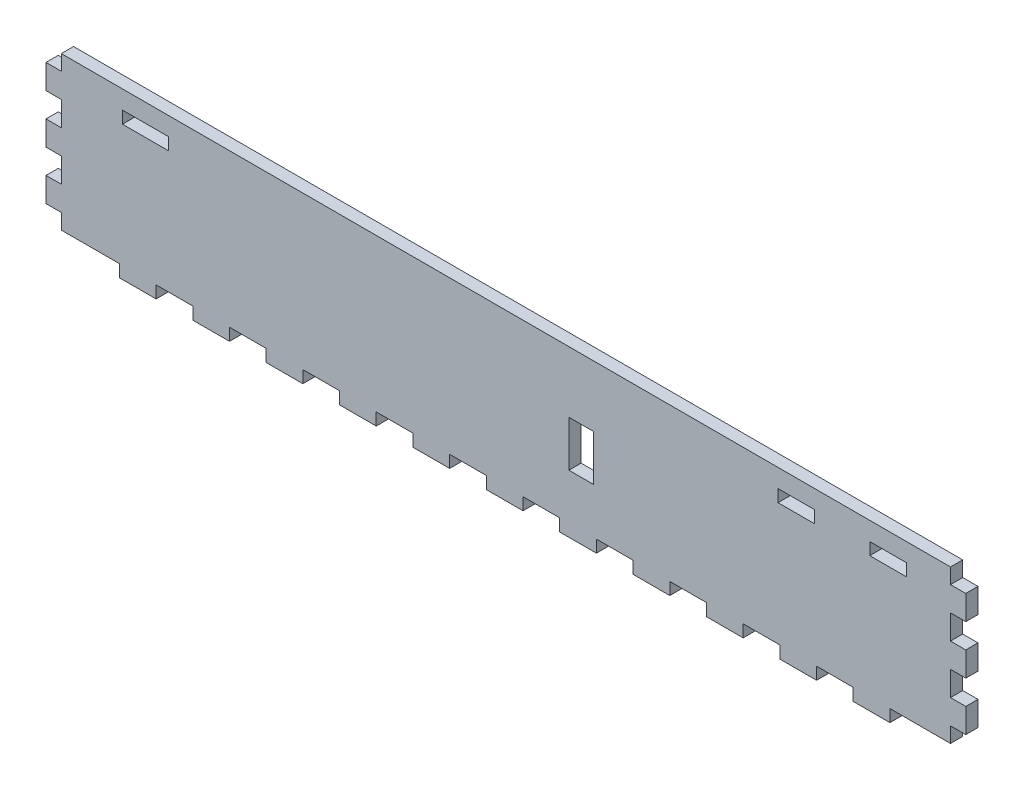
ISO-10303-21;
HEADER;
FILE_DESCRIPTION(('STEP AP214'),'2;1');
FILE_NAME('part.step','',(''),(''),'','','');
FILE_SCHEMA(('AUTOMOTIVE_DESIGN { 1 0 10303 214 1 1 1 1 }'));
ENDSEC;
DATA;
#1=APPLICATION_CONTEXT('core data for automotive mechanical design processes');
#2=APPLICATION_PROTOCOL_DEFINITION('international standard','automotive_design',2000,#1);
#3=PRODUCT_CONTEXT('',#1,'mechanical');
#4=PRODUCT('Part','Part','',(#3));
#5=PRODUCT_RELATED_PRODUCT_CATEGORY('part','',(#4));
#6=PRODUCT_DEFINITION_FORMATION('','',#4);
#7=PRODUCT_DEFINITION_CONTEXT('part definition',#1,'design');
#8=PRODUCT_DEFINITION('design','',#6,#7);
#9=PRODUCT_DEFINITION_SHAPE('','',#8);
#10=(LENGTH_UNIT() NAMED_UNIT(*) SI_UNIT(.MILLI.,.METRE.));
#11=(NAMED_UNIT(*) PLANE_ANGLE_UNIT() SI_UNIT($,.RADIAN.));
#12=(NAMED_UNIT(*) SI_UNIT($,.STERADIAN.) SOLID_ANGLE_UNIT());
#13=UNCERTAINTY_MEASURE_WITH_UNIT(LENGTH_MEASURE(1.E-05),#10,'distance_accuracy_value','');
#14=(GEOMETRIC_REPRESENTATION_CONTEXT(3) GLOBAL_UNCERTAINTY_ASSIGNED_CONTEXT((#13)) GLOBAL_UNIT_ASSIGNED_CONTEXT((#10,
#11,#12)) REPRESENTATION_CONTEXT('',''));
#15=CARTESIAN_POINT('',(0.,0.,0.));
#16=DIRECTION('',(0.,0.,1.));
#17=DIRECTION('',(1.,0.,0.));
#18=AXIS2_PLACEMENT_3D('',#15,#16,#17);
#19=CARTESIAN_POINT('',(-145.,50.,-4.));
#20=DIRECTION('',(-1.,0.,0.));
#21=DIRECTION('',(0.,0.,1.));
#22=AXIS2_PLACEMENT_3D('',#19,#20,#21);
#23=PLANE('',#22);
#24=DIRECTION('',(0.,-1.,0.));
#25=VECTOR('',#24,1.);
#26=CARTESIAN_POINT('',(-145.,50.,0.));
#27=LINE('',#26,#25);
#28=CARTESIAN_POINT('',(-145.,50.,0.));
#29=VERTEX_POINT('',#28);
#30=CARTESIAN_POINT('',(-145.,45.,0.));
#31=VERTEX_POINT('',#30);
#32=EDGE_CURVE('E703',#29,#31,#27,.T.);
#33=ORIENTED_EDGE('',*,*,#32,.F.);
#34=DIRECTION('',(0.,0.,1.));
#35=VECTOR('',#34,1.);
#36=CARTESIAN_POINT('',(-145.,50.,-4.));
#37=LINE('',#36,#35);
#38=CARTESIAN_POINT('',(-145.,50.,-4.));
#39=VERTEX_POINT('',#38);
#40=EDGE_CURVE('E11',#39,#29,#37,.T.);
#41=ORIENTED_EDGE('',*,*,#40,.F.);
#42=DIRECTION('',(0.,-1.,0.));
#43=VECTOR('',#42,1.);
#44=CARTESIAN_POINT('',(-145.,50.,-4.));
#45=LINE('',#44,#43);
#46=CARTESIAN_POINT('',(-145.,45.,-4.));
#47=VERTEX_POINT('',#46);
#48=EDGE_CURVE('E710',#39,#47,#45,.T.);
#49=ORIENTED_EDGE('',*,*,#48,.T.);
#50=DIRECTION('',(0.,0.,1.));
#51=VECTOR('',#50,1.);
#52=CARTESIAN_POINT('',(-145.,45.,-4.));
#53=LINE('',#52,#51);
#54=EDGE_CURVE('E35',#47,#31,#53,.T.);
#55=ORIENTED_EDGE('',*,*,#54,.T.);
#56=EDGE_LOOP('',(#33,#41,#49,#55));
#57=FACE_BOUND('',#56,.T.);
#58=ADVANCED_FACE('F32',(#57),#23,.T.);
#59=CARTESIAN_POINT('',(-145.,50.,-4.));
#60=DIRECTION('',(0.,1.,0.));
#61=DIRECTION('',(0.,0.,1.));
#62=AXIS2_PLACEMENT_3D('',#59,#60,#61);
#63=PLANE('',#62);
#64=DIRECTION('',(-1.,0.,0.));
#65=VECTOR('',#64,1.);
#66=CARTESIAN_POINT('',(-145.,50.,0.));
#67=LINE('',#66,#65);
#68=CARTESIAN_POINT('',(145.8,50.,0.));
#69=VERTEX_POINT('',#68);
#70=EDGE_CURVE('E714',#69,#29,#67,.T.);
#71=ORIENTED_EDGE('',*,*,#70,.F.);
#72=DIRECTION('',(0.,0.,1.));
#73=VECTOR('',#72,1.);
#74=CARTESIAN_POINT('',(145.8,50.,-4.));
#75=LINE('',#74,#73);
#76=CARTESIAN_POINT('',(145.8,50.,-4.));
#77=VERTEX_POINT('',#76);
#78=EDGE_CURVE('E40',#77,#69,#75,.T.);
#79=ORIENTED_EDGE('',*,*,#78,.F.);
#80=DIRECTION('',(-1.,0.,0.));
#81=VECTOR('',#80,1.);
#82=CARTESIAN_POINT('',(-145.,50.,-4.));
#83=LINE('',#82,#81);
#84=EDGE_CURVE('E924',#77,#39,#83,.T.);
#85=ORIENTED_EDGE('',*,*,#84,.T.);
#86=ORIENTED_EDGE('',*,*,#40,.T.);
#87=EDGE_LOOP('',(#71,#79,#85,#86));
#88=FACE_BOUND('',#87,.T.);
#89=ADVANCED_FACE('F1291',(#88),#63,.T.);
#90=CARTESIAN_POINT('',(145.8,50.,-4.));
#91=DIRECTION('',(1.,0.,0.));
#92=DIRECTION('',(0.,0.,-1.));
#93=AXIS2_PLACEMENT_3D('',#90,#91,#92);
#94=PLANE('',#93);
#95=DIRECTION('',(0.,1.,0.));
#96=VECTOR('',#95,1.);
#97=CARTESIAN_POINT('',(145.8,50.,0.));
#98=LINE('',#97,#96);
#99=CARTESIAN_POINT('',(145.8,45.,0.));
#100=VERTEX_POINT('',#99);
#101=EDGE_CURVE('E1136',#100,#69,#98,.T.);
#102=ORIENTED_EDGE('',*,*,#101,.F.);
#103=DIRECTION('',(0.,0.,1.));
#104=VECTOR('',#103,1.);
#105=CARTESIAN_POINT('',(145.8,45.,-4.));
#106=LINE('',#105,#104);
#107=CARTESIAN_POINT('',(145.8,45.,-4.));
#108=VERTEX_POINT('',#107);
#109=EDGE_CURVE('E1142',#108,#100,#106,.T.);
#110=ORIENTED_EDGE('',*,*,#109,.F.);
#111=DIRECTION('',(0.,1.,0.));
#112=VECTOR('',#111,1.);
#113=CARTESIAN_POINT('',(145.8,50.,-4.));
#114=LINE('',#113,#112);
#115=EDGE_CURVE('E921',#108,#77,#114,.T.);
#116=ORIENTED_EDGE('',*,*,#115,.T.);
#117=ORIENTED_EDGE('',*,*,#78,.T.);
#118=EDGE_LOOP('',(#102,#110,#116,#117));
#119=FACE_BOUND('',#118,.T.);
#120=ADVANCED_FACE('F1567',(#119),#94,.T.);
#121=CARTESIAN_POINT('',(145.8,45.,-4.));
#122=DIRECTION('',(0.,1.,0.));
#123=DIRECTION('',(-1.,0.,0.));
#124=AXIS2_PLACEMENT_3D('',#121,#122,#123);
#125=PLANE('',#124);
#126=DIRECTION('',(-1.,0.,0.));
#127=VECTOR('',#126,1.);
#128=CARTESIAN_POINT('',(145.8,45.,0.));
#129=LINE('',#128,#127);
#130=CARTESIAN_POINT('',(150.8,45.,0.));
#131=VERTEX_POINT('',#130);
#132=EDGE_CURVE('E1133',#131,#100,#129,.T.);
#133=ORIENTED_EDGE('',*,*,#132,.F.);
#134=DIRECTION('',(0.,0.,1.));
#135=VECTOR('',#134,1.);
#136=CARTESIAN_POINT('',(150.8,45.,-4.));
#137=LINE('',#136,#135);
#138=CARTESIAN_POINT('',(150.8,45.,-4.));
#139=VERTEX_POINT('',#138);
#140=EDGE_CURVE('E1144',#139,#131,#137,.T.);
#141=ORIENTED_EDGE('',*,*,#140,.F.);
#142=DIRECTION('',(-1.,0.,0.));
#143=VECTOR('',#142,1.);
#144=CARTESIAN_POINT('',(145.8,45.,-4.));
#145=LINE('',#144,#143);
#146=EDGE_CURVE('E918',#139,#108,#145,.T.);
#147=ORIENTED_EDGE('',*,*,#146,.T.);
#148=ORIENTED_EDGE('',*,*,#109,.T.);
#149=EDGE_LOOP('',(#133,#141,#147,#148));
#150=FACE_BOUND('',#149,.T.);
#151=ADVANCED_FACE('F1564',(#150),#125,.T.);
#152=CARTESIAN_POINT('',(150.8,45.,-4.));
#153=DIRECTION('',(1.,0.,0.));
#154=DIRECTION('',(0.,0.,-1.));
#155=AXIS2_PLACEMENT_3D('',#152,#153,#154);
#156=PLANE('',#155);
#157=DIRECTION('',(0.,1.,0.));
#158=VECTOR('',#157,1.);
#159=CARTESIAN_POINT('',(150.8,45.,0.));
#160=LINE('',#159,#158);
#161=CARTESIAN_POINT('',(150.8,37.,0.));
#162=VERTEX_POINT('',#161);
#163=EDGE_CURVE('E1130',#162,#131,#160,.T.);
#164=ORIENTED_EDGE('',*,*,#163,.F.);
#165=DIRECTION('',(0.,0.,1.));
#166=VECTOR('',#165,1.);
#167=CARTESIAN_POINT('',(150.8,37.,-4.));
#168=LINE('',#167,#166);
#169=CARTESIAN_POINT('',(150.8,37.,-4.));
#170=VERTEX_POINT('',#169);
#171=EDGE_CURVE('E1146',#170,#162,#168,.T.);
#172=ORIENTED_EDGE('',*,*,#171,.F.);
#173=DIRECTION('',(0.,1.,0.));
#174=VECTOR('',#173,1.);
#175=CARTESIAN_POINT('',(150.8,45.,-4.));
#176=LINE('',#175,#174);
#177=EDGE_CURVE('E915',#170,#139,#176,.T.);
#178=ORIENTED_EDGE('',*,*,#177,.T.);
#179=ORIENTED_EDGE('',*,*,#140,.T.);
#180=EDGE_LOOP('',(#164,#172,#178,#179));
#181=FACE_BOUND('',#180,.T.);
#182=ADVANCED_FACE('F1561',(#181),#156,.T.);
#183=CARTESIAN_POINT('',(145.8,37.,-4.));
#184=DIRECTION('',(0.,-1.,0.));
#185=DIRECTION('',(1.,0.,0.));
#186=AXIS2_PLACEMENT_3D('',#183,#184,#185);
#187=PLANE('',#186);
#188=DIRECTION('',(1.,0.,0.));
#189=VECTOR('',#188,1.);
#190=CARTESIAN_POINT('',(145.8,37.,0.));
#191=LINE('',#190,#189);
#192=CARTESIAN_POINT('',(145.8,37.,0.));
#193=VERTEX_POINT('',#192);
#194=EDGE_CURVE('E1127',#193,#162,#191,.T.);
#195=ORIENTED_EDGE('',*,*,#194,.F.);
#196=DIRECTION('',(0.,0.,1.));
#197=VECTOR('',#196,1.);
#198=CARTESIAN_POINT('',(145.8,37.,-4.));
#199=LINE('',#198,#197);
#200=CARTESIAN_POINT('',(145.8,37.,-4.));
#201=VERTEX_POINT('',#200);
#202=EDGE_CURVE('E1148',#201,#193,#199,.T.);
#203=ORIENTED_EDGE('',*,*,#202,.F.);
#204=DIRECTION('',(1.,0.,0.));
#205=VECTOR('',#204,1.);
#206=CARTESIAN_POINT('',(145.8,37.,-4.));
#207=LINE('',#206,#205);
#208=EDGE_CURVE('E912',#201,#170,#207,.T.);
#209=ORIENTED_EDGE('',*,*,#208,.T.);
#210=ORIENTED_EDGE('',*,*,#171,.T.);
#211=EDGE_LOOP('',(#195,#203,#209,#210));
#212=FACE_BOUND('',#211,.T.);
#213=ADVANCED_FACE('F1557',(#212),#187,.T.);
#214=CARTESIAN_POINT('',(145.8,37.,-4.));
#215=DIRECTION('',(1.,0.,0.));
#216=DIRECTION('',(0.,0.,-1.));
#217=AXIS2_PLACEMENT_3D('',#214,#215,#216);
#218=PLANE('',#217);
#219=DIRECTION('',(0.,1.,0.));
#220=VECTOR('',#219,1.);
#221=CARTESIAN_POINT('',(145.8,37.,0.));
#222=LINE('',#221,#220);
#223=CARTESIAN_POINT('',(145.8,29.,0.));
#224=VERTEX_POINT('',#223);
#225=EDGE_CURVE('E1124',#224,#193,#222,.T.);
#226=ORIENTED_EDGE('',*,*,#225,.F.);
#227=DIRECTION('',(0.,0.,1.));
#228=VECTOR('',#227,1.);
#229=CARTESIAN_POINT('',(145.8,29.,-4.));
#230=LINE('',#229,#228);
#231=CARTESIAN_POINT('',(145.8,29.,-4.));
#232=VERTEX_POINT('',#231);
#233=EDGE_CURVE('E1150',#232,#224,#230,.T.);
#234=ORIENTED_EDGE('',*,*,#233,.F.);
#235=DIRECTION('',(0.,1.,0.));
#236=VECTOR('',#235,1.);
#237=CARTESIAN_POINT('',(145.8,37.,-4.));
#238=LINE('',#237,#236);
#239=EDGE_CURVE('E909',#232,#201,#238,.T.);
#240=ORIENTED_EDGE('',*,*,#239,.T.);
#241=ORIENTED_EDGE('',*,*,#202,.T.);
#242=EDGE_LOOP('',(#226,#234,#240,#241));
#243=FACE_BOUND('',#242,.T.);
#244=ADVANCED_FACE('F1553',(#243),#218,.T.);
#245=CARTESIAN_POINT('',(145.8,29.,-4.));
#246=DIRECTION('',(0.,1.,0.));
#247=DIRECTION('',(0.,0.,1.));
#248=AXIS2_PLACEMENT_3D('',#245,#246,#247);
#249=PLANE('',#248);
#250=DIRECTION('',(-1.,0.,0.));
#251=VECTOR('',#250,1.);
#252=CARTESIAN_POINT('',(145.8,29.,0.));
#253=LINE('',#252,#251);
#254=CARTESIAN_POINT('',(150.8,29.,0.));
#255=VERTEX_POINT('',#254);
#256=EDGE_CURVE('E1121',#255,#224,#253,.T.);
#257=ORIENTED_EDGE('',*,*,#256,.F.);
#258=DIRECTION('',(0.,0.,1.));
#259=VECTOR('',#258,1.);
#260=CARTESIAN_POINT('',(150.8,29.,-4.));
#261=LINE('',#260,#259);
#262=CARTESIAN_POINT('',(150.8,29.,-4.));
#263=VERTEX_POINT('',#262);
#264=EDGE_CURVE('E1152',#263,#255,#261,.T.);
#265=ORIENTED_EDGE('',*,*,#264,.F.);
#266=DIRECTION('',(-1.,0.,0.));
#267=VECTOR('',#266,1.);
#268=CARTESIAN_POINT('',(145.8,29.,-4.));
#269=LINE('',#268,#267);
#270=EDGE_CURVE('E906',#263,#232,#269,.T.);
#271=ORIENTED_EDGE('',*,*,#270,.T.);
#272=ORIENTED_EDGE('',*,*,#233,.T.);
#273=EDGE_LOOP('',(#257,#265,#271,#272));
#274=FACE_BOUND('',#273,.T.);
#275=ADVANCED_FACE('F1549',(#274),#249,.T.);
#276=CARTESIAN_POINT('',(150.8,29.,-4.));
#277=DIRECTION('',(1.,0.,0.));
#278=DIRECTION('',(0.,0.,-1.));
#279=AXIS2_PLACEMENT_3D('',#276,#277,#278);
#280=PLANE('',#279);
#281=DIRECTION('',(0.,1.,0.));
#282=VECTOR('',#281,1.);
#283=CARTESIAN_POINT('',(150.8,29.,0.));
#284=LINE('',#283,#282);
#285=CARTESIAN_POINT('',(150.8,21.,0.));
#286=VERTEX_POINT('',#285);
#287=EDGE_CURVE('E1118',#286,#255,#284,.T.);
#288=ORIENTED_EDGE('',*,*,#287,.F.);
#289=DIRECTION('',(0.,0.,1.));
#290=VECTOR('',#289,1.);
#291=CARTESIAN_POINT('',(150.8,21.,-4.));
#292=LINE('',#291,#290);
#293=CARTESIAN_POINT('',(150.8,21.,-4.));
#294=VERTEX_POINT('',#293);
#295=EDGE_CURVE('E1154',#294,#286,#292,.T.);
#296=ORIENTED_EDGE('',*,*,#295,.F.);
#297=DIRECTION('',(0.,1.,0.));
#298=VECTOR('',#297,1.);
#299=CARTESIAN_POINT('',(150.8,29.,-4.));
#300=LINE('',#299,#298);
#301=EDGE_CURVE('E903',#294,#263,#300,.T.);
#302=ORIENTED_EDGE('',*,*,#301,.T.);
#303=ORIENTED_EDGE('',*,*,#264,.T.);
#304=EDGE_LOOP('',(#288,#296,#302,#303));
#305=FACE_BOUND('',#304,.T.);
#306=ADVANCED_FACE('F1545',(#305),#280,.T.);
#307=CARTESIAN_POINT('',(145.8,21.,-4.));
#308=DIRECTION('',(0.,-1.,0.));
#309=DIRECTION('',(0.,0.,-1.));
#310=AXIS2_PLACEMENT_3D('',#307,#308,#309);
#311=PLANE('',#310);
#312=DIRECTION('',(1.,0.,0.));
#313=VECTOR('',#312,1.);
#314=CARTESIAN_POINT('',(145.8,21.,0.));
#315=LINE('',#314,#313);
#316=CARTESIAN_POINT('',(145.8,21.,0.));
#317=VERTEX_POINT('',#316);
#318=EDGE_CURVE('E1115',#317,#286,#315,.T.);
#319=ORIENTED_EDGE('',*,*,#318,.F.);
#320=DIRECTION('',(0.,0.,1.));
#321=VECTOR('',#320,1.);
#322=CARTESIAN_POINT('',(145.8,21.,-4.));
#323=LINE('',#322,#321);
#324=CARTESIAN_POINT('',(145.8,21.,-4.));
#325=VERTEX_POINT('',#324);
#326=EDGE_CURVE('E1156',#325,#317,#323,.T.);
#327=ORIENTED_EDGE('',*,*,#326,.F.);
#328=DIRECTION('',(1.,0.,0.));
#329=VECTOR('',#328,1.);
#330=CARTESIAN_POINT('',(145.8,21.,-4.));
#331=LINE('',#330,#329);
#332=EDGE_CURVE('E900',#325,#294,#331,.T.);
#333=ORIENTED_EDGE('',*,*,#332,.T.);
#334=ORIENTED_EDGE('',*,*,#295,.T.);
#335=EDGE_LOOP('',(#319,#327,#333,#334));
#336=FACE_BOUND('',#335,.T.);
#337=ADVANCED_FACE('F1541',(#336),#311,.T.);
#338=CARTESIAN_POINT('',(145.8,21.,-4.));
#339=DIRECTION('',(1.,0.,0.));
#340=DIRECTION('',(0.,0.,-1.));
#341=AXIS2_PLACEMENT_3D('',#338,#339,#340);
#342=PLANE('',#341);
#343=DIRECTION('',(0.,1.,0.));
#344=VECTOR('',#343,1.);
#345=CARTESIAN_POINT('',(145.8,21.,0.));
#346=LINE('',#345,#344);
#347=CARTESIAN_POINT('',(145.8,13.,0.));
#348=VERTEX_POINT('',#347);
#349=EDGE_CURVE('E1112',#348,#317,#346,.T.);
#350=ORIENTED_EDGE('',*,*,#349,.F.);
#351=DIRECTION('',(0.,0.,1.));
#352=VECTOR('',#351,1.);
#353=CARTESIAN_POINT('',(145.8,13.,-4.));
#354=LINE('',#353,#352);
#355=CARTESIAN_POINT('',(145.8,13.,-4.));
#356=VERTEX_POINT('',#355);
#357=EDGE_CURVE('E1158',#356,#348,#354,.T.);
#358=ORIENTED_EDGE('',*,*,#357,.F.);
#359=DIRECTION('',(0.,1.,0.));
#360=VECTOR('',#359,1.);
#361=CARTESIAN_POINT('',(145.8,21.,-4.));
#362=LINE('',#361,#360);
#363=EDGE_CURVE('E897',#356,#325,#362,.T.);
#364=ORIENTED_EDGE('',*,*,#363,.T.);
#365=ORIENTED_EDGE('',*,*,#326,.T.);
#366=EDGE_LOOP('',(#350,#358,#364,#365));
#367=FACE_BOUND('',#366,.T.);
#368=ADVANCED_FACE('F1537',(#367),#342,.T.);
#369=CARTESIAN_POINT('',(145.8,13.,-4.));
#370=DIRECTION('',(0.,1.,0.));
#371=DIRECTION('',(-1.,0.,0.));
#372=AXIS2_PLACEMENT_3D('',#369,#370,#371);
#373=PLANE('',#372);
#374=DIRECTION('',(-1.,0.,0.));
#375=VECTOR('',#374,1.);
#376=CARTESIAN_POINT('',(145.8,13.,0.));
#377=LINE('',#376,#375);
#378=CARTESIAN_POINT('',(150.8,13.,0.));
#379=VERTEX_POINT('',#378);
#380=EDGE_CURVE('E1109',#379,#348,#377,.T.);
#381=ORIENTED_EDGE('',*,*,#380,.F.);
#382=DIRECTION('',(0.,0.,1.));
#383=VECTOR('',#382,1.);
#384=CARTESIAN_POINT('',(150.8,13.,-4.));
#385=LINE('',#384,#383);
#386=CARTESIAN_POINT('',(150.8,13.,-4.));
#387=VERTEX_POINT('',#386);
#388=EDGE_CURVE('E1160',#387,#379,#385,.T.);
#389=ORIENTED_EDGE('',*,*,#388,.F.);
#390=DIRECTION('',(-1.,0.,0.));
#391=VECTOR('',#390,1.);
#392=CARTESIAN_POINT('',(145.8,13.,-4.));
#393=LINE('',#392,#391);
#394=EDGE_CURVE('E894',#387,#356,#393,.T.);
#395=ORIENTED_EDGE('',*,*,#394,.T.);
#396=ORIENTED_EDGE('',*,*,#357,.T.);
#397=EDGE_LOOP('',(#381,#389,#395,#396));
#398=FACE_BOUND('',#397,.T.);
#399=ADVANCED_FACE('F1533',(#398),#373,.T.);
#400=CARTESIAN_POINT('',(150.8,13.,-4.));
#401=DIRECTION('',(1.,0.,0.));
#402=DIRECTION('',(0.,0.,-1.));
#403=AXIS2_PLACEMENT_3D('',#400,#401,#402);
#404=PLANE('',#403);
#405=DIRECTION('',(0.,1.,0.));
#406=VECTOR('',#405,1.);
#407=CARTESIAN_POINT('',(150.8,13.,0.));
#408=LINE('',#407,#406);
#409=CARTESIAN_POINT('',(150.8,5.,0.));
#410=VERTEX_POINT('',#409);
#411=EDGE_CURVE('E1106',#410,#379,#408,.T.);
#412=ORIENTED_EDGE('',*,*,#411,.F.);
#413=DIRECTION('',(0.,0.,1.));
#414=VECTOR('',#413,1.);
#415=CARTESIAN_POINT('',(150.8,5.,-4.));
#416=LINE('',#415,#414);
#417=CARTESIAN_POINT('',(150.8,5.,-4.));
#418=VERTEX_POINT('',#417);
#419=EDGE_CURVE('E1162',#418,#410,#416,.T.);
#420=ORIENTED_EDGE('',*,*,#419,.F.);
#421=DIRECTION('',(0.,1.,0.));
#422=VECTOR('',#421,1.);
#423=CARTESIAN_POINT('',(150.8,13.,-4.));
#424=LINE('',#423,#422);
#425=EDGE_CURVE('E891',#418,#387,#424,.T.);
#426=ORIENTED_EDGE('',*,*,#425,.T.);
#427=ORIENTED_EDGE('',*,*,#388,.T.);
#428=EDGE_LOOP('',(#412,#420,#426,#427));
#429=FACE_BOUND('',#428,.T.);
#430=ADVANCED_FACE('F1529',(#429),#404,.T.);
#431=CARTESIAN_POINT('',(145.8,5.,-4.));
#432=DIRECTION('',(0.,-1.,0.));
#433=DIRECTION('',(1.,0.,0.));
#434=AXIS2_PLACEMENT_3D('',#431,#432,#433);
#435=PLANE('',#434);
#436=DIRECTION('',(1.,0.,0.));
#437=VECTOR('',#436,1.);
#438=CARTESIAN_POINT('',(145.8,5.,0.));
#439=LINE('',#438,#437);
#440=CARTESIAN_POINT('',(145.8,5.,0.));
#441=VERTEX_POINT('',#440);
#442=EDGE_CURVE('E1103',#441,#410,#439,.T.);
#443=ORIENTED_EDGE('',*,*,#442,.F.);
#444=DIRECTION('',(0.,0.,1.));
#445=VECTOR('',#444,1.);
#446=CARTESIAN_POINT('',(145.8,5.,-4.));
#447=LINE('',#446,#445);
#448=CARTESIAN_POINT('',(145.8,5.,-4.));
#449=VERTEX_POINT('',#448);
#450=EDGE_CURVE('E1164',#449,#441,#447,.T.);
#451=ORIENTED_EDGE('',*,*,#450,.F.);
#452=DIRECTION('',(1.,0.,0.));
#453=VECTOR('',#452,1.);
#454=CARTESIAN_POINT('',(145.8,5.,-4.));
#455=LINE('',#454,#453);
#456=EDGE_CURVE('E888',#449,#418,#455,.T.);
#457=ORIENTED_EDGE('',*,*,#456,.T.);
#458=ORIENTED_EDGE('',*,*,#419,.T.);
#459=EDGE_LOOP('',(#443,#451,#457,#458));
#460=FACE_BOUND('',#459,.T.);
#461=ADVANCED_FACE('F1525',(#460),#435,.T.);
#462=CARTESIAN_POINT('',(145.8,5.,-4.));
#463=DIRECTION('',(1.,0.,0.));
#464=DIRECTION('',(0.,0.,-1.));
#465=AXIS2_PLACEMENT_3D('',#462,#463,#464);
#466=PLANE('',#465);
#467=DIRECTION('',(0.,1.,0.));
#468=VECTOR('',#467,1.);
#469=CARTESIAN_POINT('',(145.8,5.,0.));
#470=LINE('',#469,#468);
#471=CARTESIAN_POINT('',(145.8,5.19971417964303E-13,0.));
#472=VERTEX_POINT('',#471);
#473=EDGE_CURVE('E1100',#472,#441,#470,.T.);
#474=ORIENTED_EDGE('',*,*,#473,.F.);
#475=DIRECTION('',(0.,0.,1.));
#476=VECTOR('',#475,1.);
#477=CARTESIAN_POINT('',(145.8,5.19971417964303E-13,-4.));
#478=LINE('',#477,#476);
#479=CARTESIAN_POINT('',(145.8,5.19971417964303E-13,-4.));
#480=VERTEX_POINT('',#479);
#481=EDGE_CURVE('E1166',#480,#472,#478,.T.);
#482=ORIENTED_EDGE('',*,*,#481,.F.);
#483=DIRECTION('',(0.,1.,0.));
#484=VECTOR('',#483,1.);
#485=CARTESIAN_POINT('',(145.8,5.,-4.));
#486=LINE('',#485,#484);
#487=EDGE_CURVE('E885',#480,#449,#486,.T.);
#488=ORIENTED_EDGE('',*,*,#487,.T.);
#489=ORIENTED_EDGE('',*,*,#450,.T.);
#490=EDGE_LOOP('',(#474,#482,#488,#489));
#491=FACE_BOUND('',#490,.T.);
#492=ADVANCED_FACE('F1521',(#491),#466,.T.);
#493=CARTESIAN_POINT('',(126.,0.,-4.));
#494=DIRECTION('',(0.,-1.,0.));
#495=DIRECTION('',(1.,0.,0.));
#496=AXIS2_PLACEMENT_3D('',#493,#494,#495);
#497=PLANE('',#496);
#498=DIRECTION('',(1.,0.,0.));
#499=VECTOR('',#498,1.);
#500=CARTESIAN_POINT('',(126.,0.,0.));
#501=LINE('',#500,#499);
#502=CARTESIAN_POINT('',(126.,0.,0.));
#503=VERTEX_POINT('',#502);
#504=EDGE_CURVE('E1097',#503,#472,#501,.T.);
#505=ORIENTED_EDGE('',*,*,#504,.F.);
#506=DIRECTION('',(0.,0.,1.));
#507=VECTOR('',#506,1.);
#508=CARTESIAN_POINT('',(126.,0.,-4.));
#509=LINE('',#508,#507);
#510=CARTESIAN_POINT('',(126.,0.,-4.));
#511=VERTEX_POINT('',#510);
#512=EDGE_CURVE('E1168',#511,#503,#509,.T.);
#513=ORIENTED_EDGE('',*,*,#512,.F.);
#514=DIRECTION('',(1.,0.,0.));
#515=VECTOR('',#514,1.);
#516=CARTESIAN_POINT('',(126.,0.,-4.));
#517=LINE('',#516,#515);
#518=EDGE_CURVE('E882',#511,#480,#517,.T.);
#519=ORIENTED_EDGE('',*,*,#518,.T.);
#520=ORIENTED_EDGE('',*,*,#481,.T.);
#521=EDGE_LOOP('',(#505,#513,#519,#520));
#522=FACE_BOUND('',#521,.T.);
#523=ADVANCED_FACE('F1517',(#522),#497,.T.);
#524=CARTESIAN_POINT('',(126.,0.,-4.));
#525=DIRECTION('',(1.,0.,0.));
#526=DIRECTION('',(0.,1.,0.));
#527=AXIS2_PLACEMENT_3D('',#524,#525,#526);
#528=PLANE('',#527);
#529=DIRECTION('',(0.,1.,0.));
#530=VECTOR('',#529,1.);
#531=CARTESIAN_POINT('',(126.,0.,0.));
#532=LINE('',#531,#530);
#533=CARTESIAN_POINT('',(126.,-4.,0.));
#534=VERTEX_POINT('',#533);
#535=EDGE_CURVE('E1094',#534,#503,#532,.T.);
#536=ORIENTED_EDGE('',*,*,#535,.F.);
#537=DIRECTION('',(0.,0.,1.));
#538=VECTOR('',#537,1.);
#539=CARTESIAN_POINT('',(126.,-4.,-4.));
#540=LINE('',#539,#538);
#541=CARTESIAN_POINT('',(126.,-4.,-4.));
#542=VERTEX_POINT('',#541);
#543=EDGE_CURVE('E1170',#542,#534,#540,.T.);
#544=ORIENTED_EDGE('',*,*,#543,.F.);
#545=DIRECTION('',(0.,1.,0.));
#546=VECTOR('',#545,1.);
#547=CARTESIAN_POINT('',(126.,0.,-4.));
#548=LINE('',#547,#546);
#549=EDGE_CURVE('E879',#542,#511,#548,.T.);
#550=ORIENTED_EDGE('',*,*,#549,.T.);
#551=ORIENTED_EDGE('',*,*,#512,.T.);
#552=EDGE_LOOP('',(#536,#544,#550,#551));
#553=FACE_BOUND('',#552,.T.);
#554=ADVANCED_FACE('F1513',(#553),#528,.T.);
#555=CARTESIAN_POINT('',(114.,-3.99999999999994,-4.));
#556=DIRECTION('',(0.,-1.,0.));
#557=DIRECTION('',(1.,0.,0.));
#558=AXIS2_PLACEMENT_3D('',#555,#556,#557);
#559=PLANE('',#558);
#560=DIRECTION('',(1.,0.,0.));
#561=VECTOR('',#560,1.);
#562=CARTESIAN_POINT('',(114.,-3.99999999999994,0.));
#563=LINE('',#562,#561);
#564=CARTESIAN_POINT('',(114.,-3.99999999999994,0.));
#565=VERTEX_POINT('',#564);
#566=EDGE_CURVE('E1091',#565,#534,#563,.T.);
#567=ORIENTED_EDGE('',*,*,#566,.F.);
#568=DIRECTION('',(0.,0.,1.));
#569=VECTOR('',#568,1.);
#570=CARTESIAN_POINT('',(114.,-3.99999999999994,-4.));
#571=LINE('',#570,#569);
#572=CARTESIAN_POINT('',(114.,-3.99999999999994,-4.));
#573=VERTEX_POINT('',#572);
#574=EDGE_CURVE('E1172',#573,#565,#571,.T.);
#575=ORIENTED_EDGE('',*,*,#574,.F.);
#576=DIRECTION('',(1.,0.,0.));
#577=VECTOR('',#576,1.);
#578=CARTESIAN_POINT('',(114.,-3.99999999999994,-4.));
#579=LINE('',#578,#577);
#580=EDGE_CURVE('E876',#573,#542,#579,.T.);
#581=ORIENTED_EDGE('',*,*,#580,.T.);
#582=ORIENTED_EDGE('',*,*,#543,.T.);
#583=EDGE_LOOP('',(#567,#575,#581,#582));
#584=FACE_BOUND('',#583,.T.);
#585=ADVANCED_FACE('F1509',(#584),#559,.T.);
#586=CARTESIAN_POINT('',(114.,0.,-4.));
#587=DIRECTION('',(-1.,0.,0.));
#588=DIRECTION('',(0.,-1.,0.));
#589=AXIS2_PLACEMENT_3D('',#586,#587,#588);
#590=PLANE('',#589);
#591=DIRECTION('',(0.,-1.,0.));
#592=VECTOR('',#591,1.);
#593=CARTESIAN_POINT('',(114.,0.,0.));
#594=LINE('',#593,#592);
#595=CARTESIAN_POINT('',(114.,0.,0.));
#596=VERTEX_POINT('',#595);
#597=EDGE_CURVE('E1088',#596,#565,#594,.T.);
#598=ORIENTED_EDGE('',*,*,#597,.F.);
#599=DIRECTION('',(0.,0.,1.));
#600=VECTOR('',#599,1.);
#601=CARTESIAN_POINT('',(114.,0.,-4.));
#602=LINE('',#601,#600);
#603=CARTESIAN_POINT('',(114.,0.,-4.));
#604=VERTEX_POINT('',#603);
#605=EDGE_CURVE('E1174',#604,#596,#602,.T.);
#606=ORIENTED_EDGE('',*,*,#605,.F.);
#607=DIRECTION('',(0.,-1.,0.));
#608=VECTOR('',#607,1.);
#609=CARTESIAN_POINT('',(114.,0.,-4.));
#610=LINE('',#609,#608);
#611=EDGE_CURVE('E873',#604,#573,#610,.T.);
#612=ORIENTED_EDGE('',*,*,#611,.T.);
#613=ORIENTED_EDGE('',*,*,#574,.T.);
#614=EDGE_LOOP('',(#598,#606,#612,#613));
#615=FACE_BOUND('',#614,.T.);
#616=ADVANCED_FACE('F1505',(#615),#590,.T.);
#617=CARTESIAN_POINT('',(102.,0.,-4.));
#618=DIRECTION('',(0.,-1.,0.));
#619=DIRECTION('',(1.,0.,0.));
#620=AXIS2_PLACEMENT_3D('',#617,#618,#619);
#621=PLANE('',#620);
#622=DIRECTION('',(1.,0.,0.));
#623=VECTOR('',#622,1.);
#624=CARTESIAN_POINT('',(102.,0.,0.));
#625=LINE('',#624,#623);
#626=CARTESIAN_POINT('',(102.,0.,0.));
#627=VERTEX_POINT('',#626);
#628=EDGE_CURVE('E1085',#627,#596,#625,.T.);
#629=ORIENTED_EDGE('',*,*,#628,.F.);
#630=DIRECTION('',(0.,0.,1.));
#631=VECTOR('',#630,1.);
#632=CARTESIAN_POINT('',(102.,0.,-4.));
#633=LINE('',#632,#631);
#634=CARTESIAN_POINT('',(102.,0.,-4.));
#635=VERTEX_POINT('',#634);
#636=EDGE_CURVE('E1176',#635,#627,#633,.T.);
#637=ORIENTED_EDGE('',*,*,#636,.F.);
#638=DIRECTION('',(1.,0.,0.));
#639=VECTOR('',#638,1.);
#640=CARTESIAN_POINT('',(102.,0.,-4.));
#641=LINE('',#640,#639);
#642=EDGE_CURVE('E870',#635,#604,#641,.T.);
#643=ORIENTED_EDGE('',*,*,#642,.T.);
#644=ORIENTED_EDGE('',*,*,#605,.T.);
#645=EDGE_LOOP('',(#629,#637,#643,#644));
#646=FACE_BOUND('',#645,.T.);
#647=ADVANCED_FACE('F1501',(#646),#621,.T.);
#648=CARTESIAN_POINT('',(102.,0.,-4.));
#649=DIRECTION('',(1.,0.,0.));
#650=DIRECTION('',(0.,1.,0.));
#651=AXIS2_PLACEMENT_3D('',#648,#649,#650);
#652=PLANE('',#651);
#653=DIRECTION('',(0.,1.,0.));
#654=VECTOR('',#653,1.);
#655=CARTESIAN_POINT('',(102.,0.,0.));
#656=LINE('',#655,#654);
#657=CARTESIAN_POINT('',(102.,-3.99999999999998,0.));
#658=VERTEX_POINT('',#657);
#659=EDGE_CURVE('E1082',#658,#627,#656,.T.);
#660=ORIENTED_EDGE('',*,*,#659,.F.);
#661=DIRECTION('',(0.,0.,1.));
#662=VECTOR('',#661,1.);
#663=CARTESIAN_POINT('',(102.,-3.99999999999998,-4.));
#664=LINE('',#663,#662);
#665=CARTESIAN_POINT('',(102.,-3.99999999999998,-4.));
#666=VERTEX_POINT('',#665);
#667=EDGE_CURVE('E1178',#666,#658,#664,.T.);
#668=ORIENTED_EDGE('',*,*,#667,.F.);
#669=DIRECTION('',(0.,1.,0.));
#670=VECTOR('',#669,1.);
#671=CARTESIAN_POINT('',(102.,0.,-4.));
#672=LINE('',#671,#670);
#673=EDGE_CURVE('E867',#666,#635,#672,.T.);
#674=ORIENTED_EDGE('',*,*,#673,.T.);
#675=ORIENTED_EDGE('',*,*,#636,.T.);
#676=EDGE_LOOP('',(#660,#668,#674,#675));
#677=FACE_BOUND('',#676,.T.);
#678=ADVANCED_FACE('F1497',(#677),#652,.T.);
#679=CARTESIAN_POINT('',(90.,-3.99999999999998,-4.));
#680=DIRECTION('',(0.,-1.,0.));
#681=DIRECTION('',(0.,0.,-1.));
#682=AXIS2_PLACEMENT_3D('',#679,#680,#681);
#683=PLANE('',#682);
#684=DIRECTION('',(1.,0.,0.));
#685=VECTOR('',#684,1.);
#686=CARTESIAN_POINT('',(90.,-3.99999999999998,0.));
#687=LINE('',#686,#685);
#688=CARTESIAN_POINT('',(90.,-3.99999999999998,0.));
#689=VERTEX_POINT('',#688);
#690=EDGE_CURVE('E1079',#689,#658,#687,.T.);
#691=ORIENTED_EDGE('',*,*,#690,.F.);
#692=DIRECTION('',(0.,0.,1.));
#693=VECTOR('',#692,1.);
#694=CARTESIAN_POINT('',(90.,-3.99999999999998,-4.));
#695=LINE('',#694,#693);
#696=CARTESIAN_POINT('',(90.,-3.99999999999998,-4.));
#697=VERTEX_POINT('',#696);
#698=EDGE_CURVE('E1180',#697,#689,#695,.T.);
#699=ORIENTED_EDGE('',*,*,#698,.F.);
#700=DIRECTION('',(1.,0.,0.));
#701=VECTOR('',#700,1.);
#702=CARTESIAN_POINT('',(90.,-3.99999999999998,-4.));
#703=LINE('',#702,#701);
#704=EDGE_CURVE('E864',#697,#666,#703,.T.);
#705=ORIENTED_EDGE('',*,*,#704,.T.);
#706=ORIENTED_EDGE('',*,*,#667,.T.);
#707=EDGE_LOOP('',(#691,#699,#705,#706));
#708=FACE_BOUND('',#707,.T.);
#709=ADVANCED_FACE('F1493',(#708),#683,.T.);
#710=CARTESIAN_POINT('',(90.,0.,-4.));
#711=DIRECTION('',(-1.,0.,0.));
#712=DIRECTION('',(0.,0.,1.));
#713=AXIS2_PLACEMENT_3D('',#710,#711,#712);
#714=PLANE('',#713);
#715=DIRECTION('',(0.,-1.,0.));
#716=VECTOR('',#715,1.);
#717=CARTESIAN_POINT('',(90.,0.,0.));
#718=LINE('',#717,#716);
#719=CARTESIAN_POINT('',(90.,0.,0.));
#720=VERTEX_POINT('',#719);
#721=EDGE_CURVE('E1076',#720,#689,#718,.T.);
#722=ORIENTED_EDGE('',*,*,#721,.F.);
#723=DIRECTION('',(0.,0.,1.));
#724=VECTOR('',#723,1.);
#725=CARTESIAN_POINT('',(90.,0.,-4.));
#726=LINE('',#725,#724);
#727=CARTESIAN_POINT('',(90.,0.,-4.));
#728=VERTEX_POINT('',#727);
#729=EDGE_CURVE('E1182',#728,#720,#726,.T.);
#730=ORIENTED_EDGE('',*,*,#729,.F.);
#731=DIRECTION('',(0.,-1.,0.));
#732=VECTOR('',#731,1.);
#733=CARTESIAN_POINT('',(90.,0.,-4.));
#734=LINE('',#733,#732);
#735=EDGE_CURVE('E861',#728,#697,#734,.T.);
#736=ORIENTED_EDGE('',*,*,#735,.T.);
#737=ORIENTED_EDGE('',*,*,#698,.T.);
#738=EDGE_LOOP('',(#722,#730,#736,#737));
#739=FACE_BOUND('',#738,.T.);
#740=ADVANCED_FACE('F1489',(#739),#714,.T.);
#741=CARTESIAN_POINT('',(78.,0.,-4.));
#742=DIRECTION('',(0.,-1.,0.));
#743=DIRECTION('',(1.,0.,0.));
#744=AXIS2_PLACEMENT_3D('',#741,#742,#743);
#745=PLANE('',#744);
#746=DIRECTION('',(1.,0.,0.));
#747=VECTOR('',#746,1.);
#748=CARTESIAN_POINT('',(78.,0.,0.));
#749=LINE('',#748,#747);
#750=CARTESIAN_POINT('',(78.,0.,0.));
#751=VERTEX_POINT('',#750);
#752=EDGE_CURVE('E1073',#751,#720,#749,.T.);
#753=ORIENTED_EDGE('',*,*,#752,.F.);
#754=DIRECTION('',(0.,0.,1.));
#755=VECTOR('',#754,1.);
#756=CARTESIAN_POINT('',(78.,0.,-4.));
#757=LINE('',#756,#755);
#758=CARTESIAN_POINT('',(78.,0.,-4.));
#759=VERTEX_POINT('',#758);
#760=EDGE_CURVE('E1184',#759,#751,#757,.T.);
#761=ORIENTED_EDGE('',*,*,#760,.F.);
#762=DIRECTION('',(1.,0.,0.));
#763=VECTOR('',#762,1.);
#764=CARTESIAN_POINT('',(78.,0.,-4.));
#765=LINE('',#764,#763);
#766=EDGE_CURVE('E858',#759,#728,#765,.T.);
#767=ORIENTED_EDGE('',*,*,#766,.T.);
#768=ORIENTED_EDGE('',*,*,#729,.T.);
#769=EDGE_LOOP('',(#753,#761,#767,#768));
#770=FACE_BOUND('',#769,.T.);
#771=ADVANCED_FACE('F1485',(#770),#745,.T.);
#772=CARTESIAN_POINT('',(78.,0.,-4.));
#773=DIRECTION('',(1.,0.,0.));
#774=DIRECTION('',(0.,0.,-1.));
#775=AXIS2_PLACEMENT_3D('',#772,#773,#774);
#776=PLANE('',#775);
#777=DIRECTION('',(0.,1.,0.));
#778=VECTOR('',#777,1.);
#779=CARTESIAN_POINT('',(78.,0.,0.));
#780=LINE('',#779,#778);
#781=CARTESIAN_POINT('',(78.,-3.99999999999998,0.));
#782=VERTEX_POINT('',#781);
#783=EDGE_CURVE('E1070',#782,#751,#780,.T.);
#784=ORIENTED_EDGE('',*,*,#783,.F.);
#785=DIRECTION('',(0.,0.,1.));
#786=VECTOR('',#785,1.);
#787=CARTESIAN_POINT('',(78.,-3.99999999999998,-4.));
#788=LINE('',#787,#786);
#789=CARTESIAN_POINT('',(78.,-3.99999999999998,-4.));
#790=VERTEX_POINT('',#789);
#791=EDGE_CURVE('E1186',#790,#782,#788,.T.);
#792=ORIENTED_EDGE('',*,*,#791,.F.);
#793=DIRECTION('',(0.,1.,0.));
#794=VECTOR('',#793,1.);
#795=CARTESIAN_POINT('',(78.,0.,-4.));
#796=LINE('',#795,#794);
#797=EDGE_CURVE('E855',#790,#759,#796,.T.);
#798=ORIENTED_EDGE('',*,*,#797,.T.);
#799=ORIENTED_EDGE('',*,*,#760,.T.);
#800=EDGE_LOOP('',(#784,#792,#798,#799));
#801=FACE_BOUND('',#800,.T.);
#802=ADVANCED_FACE('F1481',(#801),#776,.T.);
#803=CARTESIAN_POINT('',(66.,-3.99999999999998,-4.));
#804=DIRECTION('',(0.,-1.,0.));
#805=DIRECTION('',(0.,0.,-1.));
#806=AXIS2_PLACEMENT_3D('',#803,#804,#805);
#807=PLANE('',#806);
#808=DIRECTION('',(1.,0.,0.));
#809=VECTOR('',#808,1.);
#810=CARTESIAN_POINT('',(66.,-3.99999999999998,0.));
#811=LINE('',#810,#809);
#812=CARTESIAN_POINT('',(66.,-3.99999999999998,0.));
#813=VERTEX_POINT('',#812);
#814=EDGE_CURVE('E1067',#813,#782,#811,.T.);
#815=ORIENTED_EDGE('',*,*,#814,.F.);
#816=DIRECTION('',(0.,0.,1.));
#817=VECTOR('',#816,1.);
#818=CARTESIAN_POINT('',(66.,-3.99999999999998,-4.));
#819=LINE('',#818,#817);
#820=CARTESIAN_POINT('',(66.,-3.99999999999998,-4.));
#821=VERTEX_POINT('',#820);
#822=EDGE_CURVE('E1188',#821,#813,#819,.T.);
#823=ORIENTED_EDGE('',*,*,#822,.F.);
#824=DIRECTION('',(1.,0.,0.));
#825=VECTOR('',#824,1.);
#826=CARTESIAN_POINT('',(66.,-3.99999999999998,-4.));
#827=LINE('',#826,#825);
#828=EDGE_CURVE('E852',#821,#790,#827,.T.);
#829=ORIENTED_EDGE('',*,*,#828,.T.);
#830=ORIENTED_EDGE('',*,*,#791,.T.);
#831=EDGE_LOOP('',(#815,#823,#829,#830));
#832=FACE_BOUND('',#831,.T.);
#833=ADVANCED_FACE('F1477',(#832),#807,.T.);
#834=CARTESIAN_POINT('',(66.,0.,-4.));
#835=DIRECTION('',(-1.,0.,0.));
#836=DIRECTION('',(0.,0.,1.));
#837=AXIS2_PLACEMENT_3D('',#834,#835,#836);
#838=PLANE('',#837);
#839=DIRECTION('',(0.,-1.,0.));
#840=VECTOR('',#839,1.);
#841=CARTESIAN_POINT('',(66.,0.,0.));
#842=LINE('',#841,#840);
#843=CARTESIAN_POINT('',(66.,0.,0.));
#844=VERTEX_POINT('',#843);
#845=EDGE_CURVE('E1064',#844,#813,#842,.T.);
#846=ORIENTED_EDGE('',*,*,#845,.F.);
#847=DIRECTION('',(0.,0.,1.));
#848=VECTOR('',#847,1.);
#849=CARTESIAN_POINT('',(66.,0.,-4.));
#850=LINE('',#849,#848);
#851=CARTESIAN_POINT('',(66.,0.,-4.));
#852=VERTEX_POINT('',#851);
#853=EDGE_CURVE('E1190',#852,#844,#850,.T.);
#854=ORIENTED_EDGE('',*,*,#853,.F.);
#855=DIRECTION('',(0.,-1.,0.));
#856=VECTOR('',#855,1.);
#857=CARTESIAN_POINT('',(66.,0.,-4.));
#858=LINE('',#857,#856);
#859=EDGE_CURVE('E849',#852,#821,#858,.T.);
#860=ORIENTED_EDGE('',*,*,#859,.T.);
#861=ORIENTED_EDGE('',*,*,#822,.T.);
#862=EDGE_LOOP('',(#846,#854,#860,#861));
#863=FACE_BOUND('',#862,.T.);
#864=ADVANCED_FACE('F1473',(#863),#838,.T.);
#865=CARTESIAN_POINT('',(54.,0.,-4.));
#866=DIRECTION('',(0.,-1.,0.));
#867=DIRECTION('',(1.,0.,0.));
#868=AXIS2_PLACEMENT_3D('',#865,#866,#867);
#869=PLANE('',#868);
#870=DIRECTION('',(1.,0.,0.));
#871=VECTOR('',#870,1.);
#872=CARTESIAN_POINT('',(54.,0.,0.));
#873=LINE('',#872,#871);
#874=CARTESIAN_POINT('',(54.,0.,0.));
#875=VERTEX_POINT('',#874);
#876=EDGE_CURVE('E1061',#875,#844,#873,.T.);
#877=ORIENTED_EDGE('',*,*,#876,.F.);
#878=DIRECTION('',(0.,0.,1.));
#879=VECTOR('',#878,1.);
#880=CARTESIAN_POINT('',(54.,0.,-4.));
#881=LINE('',#880,#879);
#882=CARTESIAN_POINT('',(54.,0.,-4.));
#883=VERTEX_POINT('',#882);
#884=EDGE_CURVE('E1192',#883,#875,#881,.T.);
#885=ORIENTED_EDGE('',*,*,#884,.F.);
#886=DIRECTION('',(1.,0.,0.));
#887=VECTOR('',#886,1.);
#888=CARTESIAN_POINT('',(54.,0.,-4.));
#889=LINE('',#888,#887);
#890=EDGE_CURVE('E846',#883,#852,#889,.T.);
#891=ORIENTED_EDGE('',*,*,#890,.T.);
#892=ORIENTED_EDGE('',*,*,#853,.T.);
#893=EDGE_LOOP('',(#877,#885,#891,#892));
#894=FACE_BOUND('',#893,.T.);
#895=ADVANCED_FACE('F1469',(#894),#869,.T.);
#896=CARTESIAN_POINT('',(54.,0.,-4.));
#897=DIRECTION('',(1.,0.,0.));
#898=DIRECTION('',(0.,0.,-1.));
#899=AXIS2_PLACEMENT_3D('',#896,#897,#898);
#900=PLANE('',#899);
#901=DIRECTION('',(0.,1.,0.));
#902=VECTOR('',#901,1.);
#903=CARTESIAN_POINT('',(54.,0.,0.));
#904=LINE('',#903,#902);
#905=CARTESIAN_POINT('',(54.,-3.99999999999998,0.));
#906=VERTEX_POINT('',#905);
#907=EDGE_CURVE('E1058',#906,#875,#904,.T.);
#908=ORIENTED_EDGE('',*,*,#907,.F.);
#909=DIRECTION('',(0.,0.,1.));
#910=VECTOR('',#909,1.);
#911=CARTESIAN_POINT('',(54.,-3.99999999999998,-4.));
#912=LINE('',#911,#910);
#913=CARTESIAN_POINT('',(54.,-3.99999999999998,-4.));
#914=VERTEX_POINT('',#913);
#915=EDGE_CURVE('E1194',#914,#906,#912,.T.);
#916=ORIENTED_EDGE('',*,*,#915,.F.);
#917=DIRECTION('',(0.,1.,0.));
#918=VECTOR('',#917,1.);
#919=CARTESIAN_POINT('',(54.,0.,-4.));
#920=LINE('',#919,#918);
#921=EDGE_CURVE('E843',#914,#883,#920,.T.);
#922=ORIENTED_EDGE('',*,*,#921,.T.);
#923=ORIENTED_EDGE('',*,*,#884,.T.);
#924=EDGE_LOOP('',(#908,#916,#922,#923));
#925=FACE_BOUND('',#924,.T.);
#926=ADVANCED_FACE('F1465',(#925),#900,.T.);
#927=CARTESIAN_POINT('',(42.,-3.99999999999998,-4.));
#928=DIRECTION('',(0.,-1.,0.));
#929=DIRECTION('',(0.,0.,-1.));
#930=AXIS2_PLACEMENT_3D('',#927,#928,#929);
#931=PLANE('',#930);
#932=DIRECTION('',(1.,0.,0.));
#933=VECTOR('',#932,1.);
#934=CARTESIAN_POINT('',(42.,-3.99999999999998,0.));
#935=LINE('',#934,#933);
#936=CARTESIAN_POINT('',(42.,-3.99999999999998,0.));
#937=VERTEX_POINT('',#936);
#938=EDGE_CURVE('E1055',#937,#906,#935,.T.);
#939=ORIENTED_EDGE('',*,*,#938,.F.);
#940=DIRECTION('',(0.,0.,1.));
#941=VECTOR('',#940,1.);
#942=CARTESIAN_POINT('',(42.,-3.99999999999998,-4.));
#943=LINE('',#942,#941);
#944=CARTESIAN_POINT('',(42.,-3.99999999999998,-4.));
#945=VERTEX_POINT('',#944);
#946=EDGE_CURVE('E1196',#945,#937,#943,.T.);
#947=ORIENTED_EDGE('',*,*,#946,.F.);
#948=DIRECTION('',(1.,0.,0.));
#949=VECTOR('',#948,1.);
#950=CARTESIAN_POINT('',(42.,-3.99999999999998,-4.));
#951=LINE('',#950,#949);
#952=EDGE_CURVE('E840',#945,#914,#951,.T.);
#953=ORIENTED_EDGE('',*,*,#952,.T.);
#954=ORIENTED_EDGE('',*,*,#915,.T.);
#955=EDGE_LOOP('',(#939,#947,#953,#954));
#956=FACE_BOUND('',#955,.T.);
#957=ADVANCED_FACE('F1461',(#956),#931,.T.);
#958=CARTESIAN_POINT('',(42.,0.,-4.));
#959=DIRECTION('',(-1.,0.,0.));
#960=DIRECTION('',(0.,0.,1.));
#961=AXIS2_PLACEMENT_3D('',#958,#959,#960);
#962=PLANE('',#961);
#963=DIRECTION('',(0.,-1.,0.));
#964=VECTOR('',#963,1.);
#965=CARTESIAN_POINT('',(42.,0.,0.));
#966=LINE('',#965,#964);
#967=CARTESIAN_POINT('',(42.,0.,0.));
#968=VERTEX_POINT('',#967);
#969=EDGE_CURVE('E1052',#968,#937,#966,.T.);
#970=ORIENTED_EDGE('',*,*,#969,.F.);
#971=DIRECTION('',(0.,0.,1.));
#972=VECTOR('',#971,1.);
#973=CARTESIAN_POINT('',(42.,0.,-4.));
#974=LINE('',#973,#972);
#975=CARTESIAN_POINT('',(42.,0.,-4.));
#976=VERTEX_POINT('',#975);
#977=EDGE_CURVE('E1198',#976,#968,#974,.T.);
#978=ORIENTED_EDGE('',*,*,#977,.F.);
#979=DIRECTION('',(0.,-1.,0.));
#980=VECTOR('',#979,1.);
#981=CARTESIAN_POINT('',(42.,0.,-4.));
#982=LINE('',#981,#980);
#983=EDGE_CURVE('E837',#976,#945,#982,.T.);
#984=ORIENTED_EDGE('',*,*,#983,.T.);
#985=ORIENTED_EDGE('',*,*,#946,.T.);
#986=EDGE_LOOP('',(#970,#978,#984,#985));
#987=FACE_BOUND('',#986,.T.);
#988=ADVANCED_FACE('F1457',(#987),#962,.T.);
#989=CARTESIAN_POINT('',(30.,0.,-4.));
#990=DIRECTION('',(0.,-1.,0.));
#991=DIRECTION('',(1.,0.,0.));
#992=AXIS2_PLACEMENT_3D('',#989,#990,#991);
#993=PLANE('',#992);
#994=DIRECTION('',(1.,0.,0.));
#995=VECTOR('',#994,1.);
#996=CARTESIAN_POINT('',(30.,0.,0.));
#997=LINE('',#996,#995);
#998=CARTESIAN_POINT('',(30.,0.,0.));
#999=VERTEX_POINT('',#998);
#1000=EDGE_CURVE('E1049',#999,#968,#997,.T.);
#1001=ORIENTED_EDGE('',*,*,#1000,.F.);
#1002=DIRECTION('',(0.,0.,1.));
#1003=VECTOR('',#1002,1.);
#1004=CARTESIAN_POINT('',(30.,0.,-4.));
#1005=LINE('',#1004,#1003);
#1006=CARTESIAN_POINT('',(30.,0.,-4.));
#1007=VERTEX_POINT('',#1006);
#1008=EDGE_CURVE('E1200',#1007,#999,#1005,.T.);
#1009=ORIENTED_EDGE('',*,*,#1008,.F.);
#1010=DIRECTION('',(1.,0.,0.));
#1011=VECTOR('',#1010,1.);
#1012=CARTESIAN_POINT('',(30.,0.,-4.));
#1013=LINE('',#1012,#1011);
#1014=EDGE_CURVE('E834',#1007,#976,#1013,.T.);
#1015=ORIENTED_EDGE('',*,*,#1014,.T.);
#1016=ORIENTED_EDGE('',*,*,#977,.T.);
#1017=EDGE_LOOP('',(#1001,#1009,#1015,#1016));
#1018=FACE_BOUND('',#1017,.T.);
#1019=ADVANCED_FACE('F1453',(#1018),#993,.T.);
#1020=CARTESIAN_POINT('',(30.,0.,-4.));
#1021=DIRECTION('',(1.,0.,0.));
#1022=DIRECTION('',(0.,0.,-1.));
#1023=AXIS2_PLACEMENT_3D('',#1020,#1021,#1022);
#1024=PLANE('',#1023);
#1025=DIRECTION('',(0.,1.,0.));
#1026=VECTOR('',#1025,1.);
#1027=CARTESIAN_POINT('',(30.,0.,0.));
#1028=LINE('',#1027,#1026);
#1029=CARTESIAN_POINT('',(30.,-3.99999999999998,0.));
#1030=VERTEX_POINT('',#1029);
#1031=EDGE_CURVE('E1046',#1030,#999,#1028,.T.);
#1032=ORIENTED_EDGE('',*,*,#1031,.F.);
#1033=DIRECTION('',(0.,0.,1.));
#1034=VECTOR('',#1033,1.);
#1035=CARTESIAN_POINT('',(30.,-3.99999999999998,-4.));
#1036=LINE('',#1035,#1034);
#1037=CARTESIAN_POINT('',(30.,-3.99999999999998,-4.));
#1038=VERTEX_POINT('',#1037);
#1039=EDGE_CURVE('E1202',#1038,#1030,#1036,.T.);
#1040=ORIENTED_EDGE('',*,*,#1039,.F.);
#1041=DIRECTION('',(0.,1.,0.));
#1042=VECTOR('',#1041,1.);
#1043=CARTESIAN_POINT('',(30.,0.,-4.));
#1044=LINE('',#1043,#1042);
#1045=EDGE_CURVE('E831',#1038,#1007,#1044,.T.);
#1046=ORIENTED_EDGE('',*,*,#1045,.T.);
#1047=ORIENTED_EDGE('',*,*,#1008,.T.);
#1048=EDGE_LOOP('',(#1032,#1040,#1046,#1047));
#1049=FACE_BOUND('',#1048,.T.);
#1050=ADVANCED_FACE('F1449',(#1049),#1024,.T.);
#1051=CARTESIAN_POINT('',(18.,-3.99999999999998,-4.));
#1052=DIRECTION('',(0.,-1.,0.));
#1053=DIRECTION('',(0.,0.,-1.));
#1054=AXIS2_PLACEMENT_3D('',#1051,#1052,#1053);
#1055=PLANE('',#1054);
#1056=DIRECTION('',(1.,0.,0.));
#1057=VECTOR('',#1056,1.);
#1058=CARTESIAN_POINT('',(18.,-3.99999999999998,0.));
#1059=LINE('',#1058,#1057);
#1060=CARTESIAN_POINT('',(18.,-3.99999999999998,0.));
#1061=VERTEX_POINT('',#1060);
#1062=EDGE_CURVE('E1043',#1061,#1030,#1059,.T.);
#1063=ORIENTED_EDGE('',*,*,#1062,.F.);
#1064=DIRECTION('',(0.,0.,1.));
#1065=VECTOR('',#1064,1.);
#1066=CARTESIAN_POINT('',(18.,-3.99999999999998,-4.));
#1067=LINE('',#1066,#1065);
#1068=CARTESIAN_POINT('',(18.,-3.99999999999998,-4.));
#1069=VERTEX_POINT('',#1068);
#1070=EDGE_CURVE('E1204',#1069,#1061,#1067,.T.);
#1071=ORIENTED_EDGE('',*,*,#1070,.F.);
#1072=DIRECTION('',(1.,0.,0.));
#1073=VECTOR('',#1072,1.);
#1074=CARTESIAN_POINT('',(18.,-3.99999999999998,-4.));
#1075=LINE('',#1074,#1073);
#1076=EDGE_CURVE('E828',#1069,#1038,#1075,.T.);
#1077=ORIENTED_EDGE('',*,*,#1076,.T.);
#1078=ORIENTED_EDGE('',*,*,#1039,.T.);
#1079=EDGE_LOOP('',(#1063,#1071,#1077,#1078));
#1080=FACE_BOUND('',#1079,.T.);
#1081=ADVANCED_FACE('F1445',(#1080),#1055,.T.);
#1082=CARTESIAN_POINT('',(18.,0.,-4.));
#1083=DIRECTION('',(-1.,0.,0.));
#1084=DIRECTION('',(0.,0.,1.));
#1085=AXIS2_PLACEMENT_3D('',#1082,#1083,#1084);
#1086=PLANE('',#1085);
#1087=DIRECTION('',(0.,-1.,0.));
#1088=VECTOR('',#1087,1.);
#1089=CARTESIAN_POINT('',(18.,0.,0.));
#1090=LINE('',#1089,#1088);
#1091=CARTESIAN_POINT('',(18.,0.,0.));
#1092=VERTEX_POINT('',#1091);
#1093=EDGE_CURVE('E1040',#1092,#1061,#1090,.T.);
#1094=ORIENTED_EDGE('',*,*,#1093,.F.);
#1095=DIRECTION('',(0.,0.,1.));
#1096=VECTOR('',#1095,1.);
#1097=CARTESIAN_POINT('',(18.,0.,-4.));
#1098=LINE('',#1097,#1096);
#1099=CARTESIAN_POINT('',(18.,0.,-4.));
#1100=VERTEX_POINT('',#1099);
#1101=EDGE_CURVE('E1206',#1100,#1092,#1098,.T.);
#1102=ORIENTED_EDGE('',*,*,#1101,.F.);
#1103=DIRECTION('',(0.,-1.,0.));
#1104=VECTOR('',#1103,1.);
#1105=CARTESIAN_POINT('',(18.,0.,-4.));
#1106=LINE('',#1105,#1104);
#1107=EDGE_CURVE('E825',#1100,#1069,#1106,.T.);
#1108=ORIENTED_EDGE('',*,*,#1107,.T.);
#1109=ORIENTED_EDGE('',*,*,#1070,.T.);
#1110=EDGE_LOOP('',(#1094,#1102,#1108,#1109));
#1111=FACE_BOUND('',#1110,.T.);
#1112=ADVANCED_FACE('F1441',(#1111),#1086,.T.);
#1113=CARTESIAN_POINT('',(6.00000000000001,0.,-4.));
#1114=DIRECTION('',(0.,-1.,0.));
#1115=DIRECTION('',(1.,0.,0.));
#1116=AXIS2_PLACEMENT_3D('',#1113,#1114,#1115);
#1117=PLANE('',#1116);
#1118=DIRECTION('',(1.,0.,0.));
#1119=VECTOR('',#1118,1.);
#1120=CARTESIAN_POINT('',(6.00000000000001,0.,0.));
#1121=LINE('',#1120,#1119);
#1122=CARTESIAN_POINT('',(6.00000000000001,0.,0.));
#1123=VERTEX_POINT('',#1122);
#1124=EDGE_CURVE('E1037',#1123,#1092,#1121,.T.);
#1125=ORIENTED_EDGE('',*,*,#1124,.F.);
#1126=DIRECTION('',(0.,0.,1.));
#1127=VECTOR('',#1126,1.);
#1128=CARTESIAN_POINT('',(6.00000000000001,0.,-4.));
#1129=LINE('',#1128,#1127);
#1130=CARTESIAN_POINT('',(6.00000000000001,0.,-4.));
#1131=VERTEX_POINT('',#1130);
#1132=EDGE_CURVE('E1208',#1131,#1123,#1129,.T.);
#1133=ORIENTED_EDGE('',*,*,#1132,.F.);
#1134=DIRECTION('',(1.,0.,0.));
#1135=VECTOR('',#1134,1.);
#1136=CARTESIAN_POINT('',(6.00000000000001,0.,-4.));
#1137=LINE('',#1136,#1135);
#1138=EDGE_CURVE('E822',#1131,#1100,#1137,.T.);
#1139=ORIENTED_EDGE('',*,*,#1138,.T.);
#1140=ORIENTED_EDGE('',*,*,#1101,.T.);
#1141=EDGE_LOOP('',(#1125,#1133,#1139,#1140));
#1142=FACE_BOUND('',#1141,.T.);
#1143=ADVANCED_FACE('F1437',(#1142),#1117,.T.);
#1144=CARTESIAN_POINT('',(6.00000000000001,0.,-4.));
#1145=DIRECTION('',(1.,0.,0.));
#1146=DIRECTION('',(0.,0.,-1.));
#1147=AXIS2_PLACEMENT_3D('',#1144,#1145,#1146);
#1148=PLANE('',#1147);
#1149=DIRECTION('',(0.,1.,0.));
#1150=VECTOR('',#1149,1.);
#1151=CARTESIAN_POINT('',(6.00000000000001,0.,0.));
#1152=LINE('',#1151,#1150);
#1153=CARTESIAN_POINT('',(6.00000000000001,-3.99999999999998,0.));
#1154=VERTEX_POINT('',#1153);
#1155=EDGE_CURVE('E1034',#1154,#1123,#1152,.T.);
#1156=ORIENTED_EDGE('',*,*,#1155,.F.);
#1157=DIRECTION('',(0.,0.,1.));
#1158=VECTOR('',#1157,1.);
#1159=CARTESIAN_POINT('',(6.00000000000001,-3.99999999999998,-4.));
#1160=LINE('',#1159,#1158);
#1161=CARTESIAN_POINT('',(6.00000000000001,-3.99999999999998,-4.));
#1162=VERTEX_POINT('',#1161);
#1163=EDGE_CURVE('E1210',#1162,#1154,#1160,.T.);
#1164=ORIENTED_EDGE('',*,*,#1163,.F.);
#1165=DIRECTION('',(0.,1.,0.));
#1166=VECTOR('',#1165,1.);
#1167=CARTESIAN_POINT('',(6.00000000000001,0.,-4.));
#1168=LINE('',#1167,#1166);
#1169=EDGE_CURVE('E819',#1162,#1131,#1168,.T.);
#1170=ORIENTED_EDGE('',*,*,#1169,.T.);
#1171=ORIENTED_EDGE('',*,*,#1132,.T.);
#1172=EDGE_LOOP('',(#1156,#1164,#1170,#1171));
#1173=FACE_BOUND('',#1172,.T.);
#1174=ADVANCED_FACE('F1433',(#1173),#1148,.T.);
#1175=CARTESIAN_POINT('',(-6.00000000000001,-3.99999999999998,-4.));
#1176=DIRECTION('',(0.,-1.,0.));
#1177=DIRECTION('',(1.,0.,0.));
#1178=AXIS2_PLACEMENT_3D('',#1175,#1176,#1177);
#1179=PLANE('',#1178);
#1180=DIRECTION('',(1.,0.,0.));
#1181=VECTOR('',#1180,1.);
#1182=CARTESIAN_POINT('',(-6.00000000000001,-3.99999999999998,0.));
#1183=LINE('',#1182,#1181);
#1184=CARTESIAN_POINT('',(-6.00000000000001,-3.99999999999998,0.));
#1185=VERTEX_POINT('',#1184);
#1186=EDGE_CURVE('E1031',#1185,#1154,#1183,.T.);
#1187=ORIENTED_EDGE('',*,*,#1186,.F.);
#1188=DIRECTION('',(0.,0.,1.));
#1189=VECTOR('',#1188,1.);
#1190=CARTESIAN_POINT('',(-6.00000000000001,-3.99999999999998,-4.));
#1191=LINE('',#1190,#1189);
#1192=CARTESIAN_POINT('',(-6.00000000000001,-3.99999999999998,-4.));
#1193=VERTEX_POINT('',#1192);
#1194=EDGE_CURVE('E1212',#1193,#1185,#1191,.T.);
#1195=ORIENTED_EDGE('',*,*,#1194,.F.);
#1196=DIRECTION('',(1.,0.,0.));
#1197=VECTOR('',#1196,1.);
#1198=CARTESIAN_POINT('',(-6.00000000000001,-3.99999999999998,-4.));
#1199=LINE('',#1198,#1197);
#1200=EDGE_CURVE('E816',#1193,#1162,#1199,.T.);
#1201=ORIENTED_EDGE('',*,*,#1200,.T.);
#1202=ORIENTED_EDGE('',*,*,#1163,.T.);
#1203=EDGE_LOOP('',(#1187,#1195,#1201,#1202));
#1204=FACE_BOUND('',#1203,.T.);
#1205=ADVANCED_FACE('F1429',(#1204),#1179,.T.);
#1206=CARTESIAN_POINT('',(-6.00000000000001,0.,-4.));
#1207=DIRECTION('',(-1.,0.,0.));
#1208=DIRECTION('',(0.,0.,1.));
#1209=AXIS2_PLACEMENT_3D('',#1206,#1207,#1208);
#1210=PLANE('',#1209);
#1211=DIRECTION('',(0.,-1.,0.));
#1212=VECTOR('',#1211,1.);
#1213=CARTESIAN_POINT('',(-6.00000000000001,0.,0.));
#1214=LINE('',#1213,#1212);
#1215=CARTESIAN_POINT('',(-6.00000000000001,0.,0.));
#1216=VERTEX_POINT('',#1215);
#1217=EDGE_CURVE('E1028',#1216,#1185,#1214,.T.);
#1218=ORIENTED_EDGE('',*,*,#1217,.F.);
#1219=DIRECTION('',(0.,0.,1.));
#1220=VECTOR('',#1219,1.);
#1221=CARTESIAN_POINT('',(-6.00000000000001,0.,-4.));
#1222=LINE('',#1221,#1220);
#1223=CARTESIAN_POINT('',(-6.00000000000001,0.,-4.));
#1224=VERTEX_POINT('',#1223);
#1225=EDGE_CURVE('E1214',#1224,#1216,#1222,.T.);
#1226=ORIENTED_EDGE('',*,*,#1225,.F.);
#1227=DIRECTION('',(0.,-1.,0.));
#1228=VECTOR('',#1227,1.);
#1229=CARTESIAN_POINT('',(-6.00000000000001,0.,-4.));
#1230=LINE('',#1229,#1228);
#1231=EDGE_CURVE('E813',#1224,#1193,#1230,.T.);
#1232=ORIENTED_EDGE('',*,*,#1231,.T.);
#1233=ORIENTED_EDGE('',*,*,#1194,.T.);
#1234=EDGE_LOOP('',(#1218,#1226,#1232,#1233));
#1235=FACE_BOUND('',#1234,.T.);
#1236=ADVANCED_FACE('F1425',(#1235),#1210,.T.);
#1237=CARTESIAN_POINT('',(-18.,0.,-4.));
#1238=DIRECTION('',(0.,-1.,0.));
#1239=DIRECTION('',(1.,0.,0.));
#1240=AXIS2_PLACEMENT_3D('',#1237,#1238,#1239);
#1241=PLANE('',#1240);
#1242=DIRECTION('',(1.,0.,0.));
#1243=VECTOR('',#1242,1.);
#1244=CARTESIAN_POINT('',(-18.,0.,0.));
#1245=LINE('',#1244,#1243);
#1246=CARTESIAN_POINT('',(-18.,0.,0.));
#1247=VERTEX_POINT('',#1246);
#1248=EDGE_CURVE('E1025',#1247,#1216,#1245,.T.);
#1249=ORIENTED_EDGE('',*,*,#1248,.F.);
#1250=DIRECTION('',(0.,0.,1.));
#1251=VECTOR('',#1250,1.);
#1252=CARTESIAN_POINT('',(-18.,0.,-4.));
#1253=LINE('',#1252,#1251);
#1254=CARTESIAN_POINT('',(-18.,0.,-4.));
#1255=VERTEX_POINT('',#1254);
#1256=EDGE_CURVE('E1216',#1255,#1247,#1253,.T.);
#1257=ORIENTED_EDGE('',*,*,#1256,.F.);
#1258=DIRECTION('',(1.,0.,0.));
#1259=VECTOR('',#1258,1.);
#1260=CARTESIAN_POINT('',(-18.,0.,-4.));
#1261=LINE('',#1260,#1259);
#1262=EDGE_CURVE('E810',#1255,#1224,#1261,.T.);
#1263=ORIENTED_EDGE('',*,*,#1262,.T.);
#1264=ORIENTED_EDGE('',*,*,#1225,.T.);
#1265=EDGE_LOOP('',(#1249,#1257,#1263,#1264));
#1266=FACE_BOUND('',#1265,.T.);
#1267=ADVANCED_FACE('F1421',(#1266),#1241,.T.);
#1268=CARTESIAN_POINT('',(-18.,0.,-4.));
#1269=DIRECTION('',(1.,0.,0.));
#1270=DIRECTION('',(0.,0.,-1.));
#1271=AXIS2_PLACEMENT_3D('',#1268,#1269,#1270);
#1272=PLANE('',#1271);
#1273=DIRECTION('',(0.,1.,0.));
#1274=VECTOR('',#1273,1.);
#1275=CARTESIAN_POINT('',(-18.,0.,0.));
#1276=LINE('',#1275,#1274);
#1277=CARTESIAN_POINT('',(-18.,-3.99999999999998,0.));
#1278=VERTEX_POINT('',#1277);
#1279=EDGE_CURVE('E1022',#1278,#1247,#1276,.T.);
#1280=ORIENTED_EDGE('',*,*,#1279,.F.);
#1281=DIRECTION('',(0.,0.,1.));
#1282=VECTOR('',#1281,1.);
#1283=CARTESIAN_POINT('',(-18.,-3.99999999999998,-4.));
#1284=LINE('',#1283,#1282);
#1285=CARTESIAN_POINT('',(-18.,-3.99999999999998,-4.));
#1286=VERTEX_POINT('',#1285);
#1287=EDGE_CURVE('E1218',#1286,#1278,#1284,.T.);
#1288=ORIENTED_EDGE('',*,*,#1287,.F.);
#1289=DIRECTION('',(0.,1.,0.));
#1290=VECTOR('',#1289,1.);
#1291=CARTESIAN_POINT('',(-18.,0.,-4.));
#1292=LINE('',#1291,#1290);
#1293=EDGE_CURVE('E807',#1286,#1255,#1292,.T.);
#1294=ORIENTED_EDGE('',*,*,#1293,.T.);
#1295=ORIENTED_EDGE('',*,*,#1256,.T.);
#1296=EDGE_LOOP('',(#1280,#1288,#1294,#1295));
#1297=FACE_BOUND('',#1296,.T.);
#1298=ADVANCED_FACE('F1417',(#1297),#1272,.T.);
#1299=CARTESIAN_POINT('',(-30.,-3.99999999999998,-4.));
#1300=DIRECTION('',(0.,-1.,0.));
#1301=DIRECTION('',(0.,0.,-1.));
#1302=AXIS2_PLACEMENT_3D('',#1299,#1300,#1301);
#1303=PLANE('',#1302);
#1304=DIRECTION('',(1.,0.,0.));
#1305=VECTOR('',#1304,1.);
#1306=CARTESIAN_POINT('',(-30.,-3.99999999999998,0.));
#1307=LINE('',#1306,#1305);
#1308=CARTESIAN_POINT('',(-30.,-3.99999999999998,0.));
#1309=VERTEX_POINT('',#1308);
#1310=EDGE_CURVE('E1019',#1309,#1278,#1307,.T.);
#1311=ORIENTED_EDGE('',*,*,#1310,.F.);
#1312=DIRECTION('',(0.,0.,1.));
#1313=VECTOR('',#1312,1.);
#1314=CARTESIAN_POINT('',(-30.,-3.99999999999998,-4.));
#1315=LINE('',#1314,#1313);
#1316=CARTESIAN_POINT('',(-30.,-3.99999999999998,-4.));
#1317=VERTEX_POINT('',#1316);
#1318=EDGE_CURVE('E1220',#1317,#1309,#1315,.T.);
#1319=ORIENTED_EDGE('',*,*,#1318,.F.);
#1320=DIRECTION('',(1.,0.,0.));
#1321=VECTOR('',#1320,1.);
#1322=CARTESIAN_POINT('',(-30.,-3.99999999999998,-4.));
#1323=LINE('',#1322,#1321);
#1324=EDGE_CURVE('E804',#1317,#1286,#1323,.T.);
#1325=ORIENTED_EDGE('',*,*,#1324,.T.);
#1326=ORIENTED_EDGE('',*,*,#1287,.T.);
#1327=EDGE_LOOP('',(#1311,#1319,#1325,#1326));
#1328=FACE_BOUND('',#1327,.T.);
#1329=ADVANCED_FACE('F1413',(#1328),#1303,.T.);
#1330=CARTESIAN_POINT('',(-30.,0.,-4.));
#1331=DIRECTION('',(-1.,0.,0.));
#1332=DIRECTION('',(0.,0.,1.));
#1333=AXIS2_PLACEMENT_3D('',#1330,#1331,#1332);
#1334=PLANE('',#1333);
#1335=DIRECTION('',(0.,-1.,0.));
#1336=VECTOR('',#1335,1.);
#1337=CARTESIAN_POINT('',(-30.,0.,0.));
#1338=LINE('',#1337,#1336);
#1339=CARTESIAN_POINT('',(-30.,0.,0.));
#1340=VERTEX_POINT('',#1339);
#1341=EDGE_CURVE('E1016',#1340,#1309,#1338,.T.);
#1342=ORIENTED_EDGE('',*,*,#1341,.F.);
#1343=DIRECTION('',(0.,0.,1.));
#1344=VECTOR('',#1343,1.);
#1345=CARTESIAN_POINT('',(-30.,0.,-4.));
#1346=LINE('',#1345,#1344);
#1347=CARTESIAN_POINT('',(-30.,0.,-4.));
#1348=VERTEX_POINT('',#1347);
#1349=EDGE_CURVE('E1222',#1348,#1340,#1346,.T.);
#1350=ORIENTED_EDGE('',*,*,#1349,.F.);
#1351=DIRECTION('',(0.,-1.,0.));
#1352=VECTOR('',#1351,1.);
#1353=CARTESIAN_POINT('',(-30.,0.,-4.));
#1354=LINE('',#1353,#1352);
#1355=EDGE_CURVE('E801',#1348,#1317,#1354,.T.);
#1356=ORIENTED_EDGE('',*,*,#1355,.T.);
#1357=ORIENTED_EDGE('',*,*,#1318,.T.);
#1358=EDGE_LOOP('',(#1342,#1350,#1356,#1357));
#1359=FACE_BOUND('',#1358,.T.);
#1360=ADVANCED_FACE('F1409',(#1359),#1334,.T.);
#1361=CARTESIAN_POINT('',(-42.,0.,-4.));
#1362=DIRECTION('',(0.,-1.,0.));
#1363=DIRECTION('',(1.,0.,0.));
#1364=AXIS2_PLACEMENT_3D('',#1361,#1362,#1363);
#1365=PLANE('',#1364);
#1366=DIRECTION('',(1.,0.,0.));
#1367=VECTOR('',#1366,1.);
#1368=CARTESIAN_POINT('',(-42.,0.,0.));
#1369=LINE('',#1368,#1367);
#1370=CARTESIAN_POINT('',(-42.,0.,0.));
#1371=VERTEX_POINT('',#1370);
#1372=EDGE_CURVE('E1013',#1371,#1340,#1369,.T.);
#1373=ORIENTED_EDGE('',*,*,#1372,.F.);
#1374=DIRECTION('',(0.,0.,1.));
#1375=VECTOR('',#1374,1.);
#1376=CARTESIAN_POINT('',(-42.,0.,-4.));
#1377=LINE('',#1376,#1375);
#1378=CARTESIAN_POINT('',(-42.,0.,-4.));
#1379=VERTEX_POINT('',#1378);
#1380=EDGE_CURVE('E1224',#1379,#1371,#1377,.T.);
#1381=ORIENTED_EDGE('',*,*,#1380,.F.);
#1382=DIRECTION('',(1.,0.,0.));
#1383=VECTOR('',#1382,1.);
#1384=CARTESIAN_POINT('',(-42.,0.,-4.));
#1385=LINE('',#1384,#1383);
#1386=EDGE_CURVE('E798',#1379,#1348,#1385,.T.);
#1387=ORIENTED_EDGE('',*,*,#1386,.T.);
#1388=ORIENTED_EDGE('',*,*,#1349,.T.);
#1389=EDGE_LOOP('',(#1373,#1381,#1387,#1388));
#1390=FACE_BOUND('',#1389,.T.);
#1391=ADVANCED_FACE('F1405',(#1390),#1365,.T.);
#1392=CARTESIAN_POINT('',(-42.,0.,-4.));
#1393=DIRECTION('',(1.,0.,0.));
#1394=DIRECTION('',(0.,0.,-1.));
#1395=AXIS2_PLACEMENT_3D('',#1392,#1393,#1394);
#1396=PLANE('',#1395);
#1397=DIRECTION('',(0.,1.,0.));
#1398=VECTOR('',#1397,1.);
#1399=CARTESIAN_POINT('',(-42.,0.,0.));
#1400=LINE('',#1399,#1398);
#1401=CARTESIAN_POINT('',(-42.,-3.99999999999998,0.));
#1402=VERTEX_POINT('',#1401);
#1403=EDGE_CURVE('E1010',#1402,#1371,#1400,.T.);
#1404=ORIENTED_EDGE('',*,*,#1403,.F.);
#1405=DIRECTION('',(0.,0.,1.));
#1406=VECTOR('',#1405,1.);
#1407=CARTESIAN_POINT('',(-42.,-3.99999999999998,-4.));
#1408=LINE('',#1407,#1406);
#1409=CARTESIAN_POINT('',(-42.,-3.99999999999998,-4.));
#1410=VERTEX_POINT('',#1409);
#1411=EDGE_CURVE('E1226',#1410,#1402,#1408,.T.);
#1412=ORIENTED_EDGE('',*,*,#1411,.F.);
#1413=DIRECTION('',(0.,1.,0.));
#1414=VECTOR('',#1413,1.);
#1415=CARTESIAN_POINT('',(-42.,0.,-4.));
#1416=LINE('',#1415,#1414);
#1417=EDGE_CURVE('E795',#1410,#1379,#1416,.T.);
#1418=ORIENTED_EDGE('',*,*,#1417,.T.);
#1419=ORIENTED_EDGE('',*,*,#1380,.T.);
#1420=EDGE_LOOP('',(#1404,#1412,#1418,#1419));
#1421=FACE_BOUND('',#1420,.T.);
#1422=ADVANCED_FACE('F1401',(#1421),#1396,.T.);
#1423=CARTESIAN_POINT('',(-54.,-3.99999999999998,-4.));
#1424=DIRECTION('',(0.,-1.,0.));
#1425=DIRECTION('',(0.,0.,-1.));
#1426=AXIS2_PLACEMENT_3D('',#1423,#1424,#1425);
#1427=PLANE('',#1426);
#1428=DIRECTION('',(1.,0.,0.));
#1429=VECTOR('',#1428,1.);
#1430=CARTESIAN_POINT('',(-54.,-3.99999999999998,0.));
#1431=LINE('',#1430,#1429);
#1432=CARTESIAN_POINT('',(-54.,-3.99999999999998,0.));
#1433=VERTEX_POINT('',#1432);
#1434=EDGE_CURVE('E1007',#1433,#1402,#1431,.T.);
#1435=ORIENTED_EDGE('',*,*,#1434,.F.);
#1436=DIRECTION('',(0.,0.,1.));
#1437=VECTOR('',#1436,1.);
#1438=CARTESIAN_POINT('',(-54.,-3.99999999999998,-4.));
#1439=LINE('',#1438,#1437);
#1440=CARTESIAN_POINT('',(-54.,-3.99999999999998,-4.));
#1441=VERTEX_POINT('',#1440);
#1442=EDGE_CURVE('E1228',#1441,#1433,#1439,.T.);
#1443=ORIENTED_EDGE('',*,*,#1442,.F.);
#1444=DIRECTION('',(1.,0.,0.));
#1445=VECTOR('',#1444,1.);
#1446=CARTESIAN_POINT('',(-54.,-3.99999999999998,-4.));
#1447=LINE('',#1446,#1445);
#1448=EDGE_CURVE('E792',#1441,#1410,#1447,.T.);
#1449=ORIENTED_EDGE('',*,*,#1448,.T.);
#1450=ORIENTED_EDGE('',*,*,#1411,.T.);
#1451=EDGE_LOOP('',(#1435,#1443,#1449,#1450));
#1452=FACE_BOUND('',#1451,.T.);
#1453=ADVANCED_FACE('F1397',(#1452),#1427,.T.);
#1454=CARTESIAN_POINT('',(-54.,0.,-4.));
#1455=DIRECTION('',(-1.,0.,0.));
#1456=DIRECTION('',(0.,0.,1.));
#1457=AXIS2_PLACEMENT_3D('',#1454,#1455,#1456);
#1458=PLANE('',#1457);
#1459=DIRECTION('',(0.,-1.,0.));
#1460=VECTOR('',#1459,1.);
#1461=CARTESIAN_POINT('',(-54.,0.,0.));
#1462=LINE('',#1461,#1460);
#1463=CARTESIAN_POINT('',(-54.,0.,0.));
#1464=VERTEX_POINT('',#1463);
#1465=EDGE_CURVE('E1004',#1464,#1433,#1462,.T.);
#1466=ORIENTED_EDGE('',*,*,#1465,.F.);
#1467=DIRECTION('',(0.,0.,1.));
#1468=VECTOR('',#1467,1.);
#1469=CARTESIAN_POINT('',(-54.,0.,-4.));
#1470=LINE('',#1469,#1468);
#1471=CARTESIAN_POINT('',(-54.,0.,-4.));
#1472=VERTEX_POINT('',#1471);
#1473=EDGE_CURVE('E1230',#1472,#1464,#1470,.T.);
#1474=ORIENTED_EDGE('',*,*,#1473,.F.);
#1475=DIRECTION('',(0.,-1.,0.));
#1476=VECTOR('',#1475,1.);
#1477=CARTESIAN_POINT('',(-54.,0.,-4.));
#1478=LINE('',#1477,#1476);
#1479=EDGE_CURVE('E789',#1472,#1441,#1478,.T.);
#1480=ORIENTED_EDGE('',*,*,#1479,.T.);
#1481=ORIENTED_EDGE('',*,*,#1442,.T.);
#1482=EDGE_LOOP('',(#1466,#1474,#1480,#1481));
#1483=FACE_BOUND('',#1482,.T.);
#1484=ADVANCED_FACE('F1393',(#1483),#1458,.T.);
#1485=CARTESIAN_POINT('',(-66.,0.,-4.));
#1486=DIRECTION('',(0.,-1.,0.));
#1487=DIRECTION('',(1.,0.,0.));
#1488=AXIS2_PLACEMENT_3D('',#1485,#1486,#1487);
#1489=PLANE('',#1488);
#1490=DIRECTION('',(1.,0.,0.));
#1491=VECTOR('',#1490,1.);
#1492=CARTESIAN_POINT('',(-66.,0.,0.));
#1493=LINE('',#1492,#1491);
#1494=CARTESIAN_POINT('',(-66.,0.,0.));
#1495=VERTEX_POINT('',#1494);
#1496=EDGE_CURVE('E1001',#1495,#1464,#1493,.T.);
#1497=ORIENTED_EDGE('',*,*,#1496,.F.);
#1498=DIRECTION('',(0.,0.,1.));
#1499=VECTOR('',#1498,1.);
#1500=CARTESIAN_POINT('',(-66.,0.,-4.));
#1501=LINE('',#1500,#1499);
#1502=CARTESIAN_POINT('',(-66.,0.,-4.));
#1503=VERTEX_POINT('',#1502);
#1504=EDGE_CURVE('E1232',#1503,#1495,#1501,.T.);
#1505=ORIENTED_EDGE('',*,*,#1504,.F.);
#1506=DIRECTION('',(1.,0.,0.));
#1507=VECTOR('',#1506,1.);
#1508=CARTESIAN_POINT('',(-66.,0.,-4.));
#1509=LINE('',#1508,#1507);
#1510=EDGE_CURVE('E786',#1503,#1472,#1509,.T.);
#1511=ORIENTED_EDGE('',*,*,#1510,.T.);
#1512=ORIENTED_EDGE('',*,*,#1473,.T.);
#1513=EDGE_LOOP('',(#1497,#1505,#1511,#1512));
#1514=FACE_BOUND('',#1513,.T.);
#1515=ADVANCED_FACE('F1389',(#1514),#1489,.T.);
#1516=CARTESIAN_POINT('',(-66.,0.,-4.));
#1517=DIRECTION('',(1.,0.,0.));
#1518=DIRECTION('',(0.,0.,-1.));
#1519=AXIS2_PLACEMENT_3D('',#1516,#1517,#1518);
#1520=PLANE('',#1519);
#1521=DIRECTION('',(0.,1.,0.));
#1522=VECTOR('',#1521,1.);
#1523=CARTESIAN_POINT('',(-66.,0.,0.));
#1524=LINE('',#1523,#1522);
#1525=CARTESIAN_POINT('',(-66.,-3.99999999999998,0.));
#1526=VERTEX_POINT('',#1525);
#1527=EDGE_CURVE('E998',#1526,#1495,#1524,.T.);
#1528=ORIENTED_EDGE('',*,*,#1527,.F.);
#1529=DIRECTION('',(0.,0.,1.));
#1530=VECTOR('',#1529,1.);
#1531=CARTESIAN_POINT('',(-66.,-3.99999999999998,-4.));
#1532=LINE('',#1531,#1530);
#1533=CARTESIAN_POINT('',(-66.,-3.99999999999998,-4.));
#1534=VERTEX_POINT('',#1533);
#1535=EDGE_CURVE('E1234',#1534,#1526,#1532,.T.);
#1536=ORIENTED_EDGE('',*,*,#1535,.F.);
#1537=DIRECTION('',(0.,1.,0.));
#1538=VECTOR('',#1537,1.);
#1539=CARTESIAN_POINT('',(-66.,0.,-4.));
#1540=LINE('',#1539,#1538);
#1541=EDGE_CURVE('E783',#1534,#1503,#1540,.T.);
#1542=ORIENTED_EDGE('',*,*,#1541,.T.);
#1543=ORIENTED_EDGE('',*,*,#1504,.T.);
#1544=EDGE_LOOP('',(#1528,#1536,#1542,#1543));
#1545=FACE_BOUND('',#1544,.T.);
#1546=ADVANCED_FACE('F1385',(#1545),#1520,.T.);
#1547=CARTESIAN_POINT('',(-78.,-3.99999999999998,-4.));
#1548=DIRECTION('',(0.,-1.,0.));
#1549=DIRECTION('',(0.,0.,-1.));
#1550=AXIS2_PLACEMENT_3D('',#1547,#1548,#1549);
#1551=PLANE('',#1550);
#1552=DIRECTION('',(1.,0.,0.));
#1553=VECTOR('',#1552,1.);
#1554=CARTESIAN_POINT('',(-78.,-3.99999999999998,0.));
#1555=LINE('',#1554,#1553);
#1556=CARTESIAN_POINT('',(-78.,-3.99999999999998,0.));
#1557=VERTEX_POINT('',#1556);
#1558=EDGE_CURVE('E995',#1557,#1526,#1555,.T.);
#1559=ORIENTED_EDGE('',*,*,#1558,.F.);
#1560=DIRECTION('',(0.,0.,1.));
#1561=VECTOR('',#1560,1.);
#1562=CARTESIAN_POINT('',(-78.,-3.99999999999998,-4.));
#1563=LINE('',#1562,#1561);
#1564=CARTESIAN_POINT('',(-78.,-3.99999999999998,-4.));
#1565=VERTEX_POINT('',#1564);
#1566=EDGE_CURVE('E1236',#1565,#1557,#1563,.T.);
#1567=ORIENTED_EDGE('',*,*,#1566,.F.);
#1568=DIRECTION('',(1.,0.,0.));
#1569=VECTOR('',#1568,1.);
#1570=CARTESIAN_POINT('',(-78.,-3.99999999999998,-4.));
#1571=LINE('',#1570,#1569);
#1572=EDGE_CURVE('E780',#1565,#1534,#1571,.T.);
#1573=ORIENTED_EDGE('',*,*,#1572,.T.);
#1574=ORIENTED_EDGE('',*,*,#1535,.T.);
#1575=EDGE_LOOP('',(#1559,#1567,#1573,#1574));
#1576=FACE_BOUND('',#1575,.T.);
#1577=ADVANCED_FACE('F1381',(#1576),#1551,.T.);
#1578=CARTESIAN_POINT('',(-78.,0.,-4.));
#1579=DIRECTION('',(-1.,0.,0.));
#1580=DIRECTION('',(0.,0.,1.));
#1581=AXIS2_PLACEMENT_3D('',#1578,#1579,#1580);
#1582=PLANE('',#1581);
#1583=DIRECTION('',(0.,-1.,0.));
#1584=VECTOR('',#1583,1.);
#1585=CARTESIAN_POINT('',(-78.,0.,0.));
#1586=LINE('',#1585,#1584);
#1587=CARTESIAN_POINT('',(-78.,0.,0.));
#1588=VERTEX_POINT('',#1587);
#1589=EDGE_CURVE('E992',#1588,#1557,#1586,.T.);
#1590=ORIENTED_EDGE('',*,*,#1589,.F.);
#1591=DIRECTION('',(0.,0.,1.));
#1592=VECTOR('',#1591,1.);
#1593=CARTESIAN_POINT('',(-78.,0.,-4.));
#1594=LINE('',#1593,#1592);
#1595=CARTESIAN_POINT('',(-78.,0.,-4.));
#1596=VERTEX_POINT('',#1595);
#1597=EDGE_CURVE('E1238',#1596,#1588,#1594,.T.);
#1598=ORIENTED_EDGE('',*,*,#1597,.F.);
#1599=DIRECTION('',(0.,-1.,0.));
#1600=VECTOR('',#1599,1.);
#1601=CARTESIAN_POINT('',(-78.,0.,-4.));
#1602=LINE('',#1601,#1600);
#1603=EDGE_CURVE('E777',#1596,#1565,#1602,.T.);
#1604=ORIENTED_EDGE('',*,*,#1603,.T.);
#1605=ORIENTED_EDGE('',*,*,#1566,.T.);
#1606=EDGE_LOOP('',(#1590,#1598,#1604,#1605));
#1607=FACE_BOUND('',#1606,.T.);
#1608=ADVANCED_FACE('F1377',(#1607),#1582,.T.);
#1609=CARTESIAN_POINT('',(-90.,0.,-4.));
#1610=DIRECTION('',(0.,-1.,0.));
#1611=DIRECTION('',(1.,0.,0.));
#1612=AXIS2_PLACEMENT_3D('',#1609,#1610,#1611);
#1613=PLANE('',#1612);
#1614=DIRECTION('',(1.,0.,0.));
#1615=VECTOR('',#1614,1.);
#1616=CARTESIAN_POINT('',(-90.,0.,0.));
#1617=LINE('',#1616,#1615);
#1618=CARTESIAN_POINT('',(-90.,0.,0.));
#1619=VERTEX_POINT('',#1618);
#1620=EDGE_CURVE('E989',#1619,#1588,#1617,.T.);
#1621=ORIENTED_EDGE('',*,*,#1620,.F.);
#1622=DIRECTION('',(0.,0.,1.));
#1623=VECTOR('',#1622,1.);
#1624=CARTESIAN_POINT('',(-90.,0.,-4.));
#1625=LINE('',#1624,#1623);
#1626=CARTESIAN_POINT('',(-90.,0.,-4.));
#1627=VERTEX_POINT('',#1626);
#1628=EDGE_CURVE('E1240',#1627,#1619,#1625,.T.);
#1629=ORIENTED_EDGE('',*,*,#1628,.F.);
#1630=DIRECTION('',(1.,0.,0.));
#1631=VECTOR('',#1630,1.);
#1632=CARTESIAN_POINT('',(-90.,0.,-4.));
#1633=LINE('',#1632,#1631);
#1634=EDGE_CURVE('E774',#1627,#1596,#1633,.T.);
#1635=ORIENTED_EDGE('',*,*,#1634,.T.);
#1636=ORIENTED_EDGE('',*,*,#1597,.T.);
#1637=EDGE_LOOP('',(#1621,#1629,#1635,#1636));
#1638=FACE_BOUND('',#1637,.T.);
#1639=ADVANCED_FACE('F1373',(#1638),#1613,.T.);
#1640=CARTESIAN_POINT('',(-90.,0.,-4.));
#1641=DIRECTION('',(1.,0.,0.));
#1642=DIRECTION('',(0.,0.,-1.));
#1643=AXIS2_PLACEMENT_3D('',#1640,#1641,#1642);
#1644=PLANE('',#1643);
#1645=DIRECTION('',(0.,1.,0.));
#1646=VECTOR('',#1645,1.);
#1647=CARTESIAN_POINT('',(-90.,0.,0.));
#1648=LINE('',#1647,#1646);
#1649=CARTESIAN_POINT('',(-90.,-3.99999999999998,0.));
#1650=VERTEX_POINT('',#1649);
#1651=EDGE_CURVE('E986',#1650,#1619,#1648,.T.);
#1652=ORIENTED_EDGE('',*,*,#1651,.F.);
#1653=DIRECTION('',(0.,0.,1.));
#1654=VECTOR('',#1653,1.);
#1655=CARTESIAN_POINT('',(-90.,-3.99999999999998,-4.));
#1656=LINE('',#1655,#1654);
#1657=CARTESIAN_POINT('',(-90.,-3.99999999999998,-4.));
#1658=VERTEX_POINT('',#1657);
#1659=EDGE_CURVE('E1242',#1658,#1650,#1656,.T.);
#1660=ORIENTED_EDGE('',*,*,#1659,.F.);
#1661=DIRECTION('',(0.,1.,0.));
#1662=VECTOR('',#1661,1.);
#1663=CARTESIAN_POINT('',(-90.,0.,-4.));
#1664=LINE('',#1663,#1662);
#1665=EDGE_CURVE('E771',#1658,#1627,#1664,.T.);
#1666=ORIENTED_EDGE('',*,*,#1665,.T.);
#1667=ORIENTED_EDGE('',*,*,#1628,.T.);
#1668=EDGE_LOOP('',(#1652,#1660,#1666,#1667));
#1669=FACE_BOUND('',#1668,.T.);
#1670=ADVANCED_FACE('F1369',(#1669),#1644,.T.);
#1671=CARTESIAN_POINT('',(-102.,-3.99999999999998,-4.));
#1672=DIRECTION('',(0.,-1.,0.));
#1673=DIRECTION('',(0.,0.,-1.));
#1674=AXIS2_PLACEMENT_3D('',#1671,#1672,#1673);
#1675=PLANE('',#1674);
#1676=DIRECTION('',(1.,0.,0.));
#1677=VECTOR('',#1676,1.);
#1678=CARTESIAN_POINT('',(-102.,-3.99999999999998,0.));
#1679=LINE('',#1678,#1677);
#1680=CARTESIAN_POINT('',(-102.,-3.99999999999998,0.));
#1681=VERTEX_POINT('',#1680);
#1682=EDGE_CURVE('E983',#1681,#1650,#1679,.T.);
#1683=ORIENTED_EDGE('',*,*,#1682,.F.);
#1684=DIRECTION('',(0.,0.,1.));
#1685=VECTOR('',#1684,1.);
#1686=CARTESIAN_POINT('',(-102.,-3.99999999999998,-4.));
#1687=LINE('',#1686,#1685);
#1688=CARTESIAN_POINT('',(-102.,-3.99999999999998,-4.));
#1689=VERTEX_POINT('',#1688);
#1690=EDGE_CURVE('E1244',#1689,#1681,#1687,.T.);
#1691=ORIENTED_EDGE('',*,*,#1690,.F.);
#1692=DIRECTION('',(1.,0.,0.));
#1693=VECTOR('',#1692,1.);
#1694=CARTESIAN_POINT('',(-102.,-3.99999999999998,-4.));
#1695=LINE('',#1694,#1693);
#1696=EDGE_CURVE('E768',#1689,#1658,#1695,.T.);
#1697=ORIENTED_EDGE('',*,*,#1696,.T.);
#1698=ORIENTED_EDGE('',*,*,#1659,.T.);
#1699=EDGE_LOOP('',(#1683,#1691,#1697,#1698));
#1700=FACE_BOUND('',#1699,.T.);
#1701=ADVANCED_FACE('F1365',(#1700),#1675,.T.);
#1702=CARTESIAN_POINT('',(-102.,0.,-4.));
#1703=DIRECTION('',(-1.,0.,0.));
#1704=DIRECTION('',(0.,0.,1.));
#1705=AXIS2_PLACEMENT_3D('',#1702,#1703,#1704);
#1706=PLANE('',#1705);
#1707=DIRECTION('',(0.,-1.,0.));
#1708=VECTOR('',#1707,1.);
#1709=CARTESIAN_POINT('',(-102.,0.,0.));
#1710=LINE('',#1709,#1708);
#1711=CARTESIAN_POINT('',(-102.,0.,0.));
#1712=VERTEX_POINT('',#1711);
#1713=EDGE_CURVE('E980',#1712,#1681,#1710,.T.);
#1714=ORIENTED_EDGE('',*,*,#1713,.F.);
#1715=DIRECTION('',(0.,0.,1.));
#1716=VECTOR('',#1715,1.);
#1717=CARTESIAN_POINT('',(-102.,0.,-4.));
#1718=LINE('',#1717,#1716);
#1719=CARTESIAN_POINT('',(-102.,0.,-4.));
#1720=VERTEX_POINT('',#1719);
#1721=EDGE_CURVE('E1246',#1720,#1712,#1718,.T.);
#1722=ORIENTED_EDGE('',*,*,#1721,.F.);
#1723=DIRECTION('',(0.,-1.,0.));
#1724=VECTOR('',#1723,1.);
#1725=CARTESIAN_POINT('',(-102.,0.,-4.));
#1726=LINE('',#1725,#1724);
#1727=EDGE_CURVE('E765',#1720,#1689,#1726,.T.);
#1728=ORIENTED_EDGE('',*,*,#1727,.T.);
#1729=ORIENTED_EDGE('',*,*,#1690,.T.);
#1730=EDGE_LOOP('',(#1714,#1722,#1728,#1729));
#1731=FACE_BOUND('',#1730,.T.);
#1732=ADVANCED_FACE('F1361',(#1731),#1706,.T.);
#1733=CARTESIAN_POINT('',(-114.,0.,-4.));
#1734=DIRECTION('',(0.,-1.,0.));
#1735=DIRECTION('',(1.,0.,0.));
#1736=AXIS2_PLACEMENT_3D('',#1733,#1734,#1735);
#1737=PLANE('',#1736);
#1738=DIRECTION('',(1.,0.,0.));
#1739=VECTOR('',#1738,1.);
#1740=CARTESIAN_POINT('',(-114.,0.,0.));
#1741=LINE('',#1740,#1739);
#1742=CARTESIAN_POINT('',(-114.,0.,0.));
#1743=VERTEX_POINT('',#1742);
#1744=EDGE_CURVE('E977',#1743,#1712,#1741,.T.);
#1745=ORIENTED_EDGE('',*,*,#1744,.F.);
#1746=DIRECTION('',(0.,0.,1.));
#1747=VECTOR('',#1746,1.);
#1748=CARTESIAN_POINT('',(-114.,0.,-4.));
#1749=LINE('',#1748,#1747);
#1750=CARTESIAN_POINT('',(-114.,0.,-4.));
#1751=VERTEX_POINT('',#1750);
#1752=EDGE_CURVE('E1248',#1751,#1743,#1749,.T.);
#1753=ORIENTED_EDGE('',*,*,#1752,.F.);
#1754=DIRECTION('',(1.,0.,0.));
#1755=VECTOR('',#1754,1.);
#1756=CARTESIAN_POINT('',(-114.,0.,-4.));
#1757=LINE('',#1756,#1755);
#1758=EDGE_CURVE('E762',#1751,#1720,#1757,.T.);
#1759=ORIENTED_EDGE('',*,*,#1758,.T.);
#1760=ORIENTED_EDGE('',*,*,#1721,.T.);
#1761=EDGE_LOOP('',(#1745,#1753,#1759,#1760));
#1762=FACE_BOUND('',#1761,.T.);
#1763=ADVANCED_FACE('F1357',(#1762),#1737,.T.);
#1764=CARTESIAN_POINT('',(-114.,0.,-4.));
#1765=DIRECTION('',(1.,0.,0.));
#1766=DIRECTION('',(0.,0.,-1.));
#1767=AXIS2_PLACEMENT_3D('',#1764,#1765,#1766);
#1768=PLANE('',#1767);
#1769=DIRECTION('',(0.,1.,0.));
#1770=VECTOR('',#1769,1.);
#1771=CARTESIAN_POINT('',(-114.,0.,0.));
#1772=LINE('',#1771,#1770);
#1773=CARTESIAN_POINT('',(-114.,-3.99999999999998,0.));
#1774=VERTEX_POINT('',#1773);
#1775=EDGE_CURVE('E974',#1774,#1743,#1772,.T.);
#1776=ORIENTED_EDGE('',*,*,#1775,.F.);
#1777=DIRECTION('',(0.,0.,1.));
#1778=VECTOR('',#1777,1.);
#1779=CARTESIAN_POINT('',(-114.,-3.99999999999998,-4.));
#1780=LINE('',#1779,#1778);
#1781=CARTESIAN_POINT('',(-114.,-3.99999999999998,-4.));
#1782=VERTEX_POINT('',#1781);
#1783=EDGE_CURVE('E1250',#1782,#1774,#1780,.T.);
#1784=ORIENTED_EDGE('',*,*,#1783,.F.);
#1785=DIRECTION('',(0.,1.,0.));
#1786=VECTOR('',#1785,1.);
#1787=CARTESIAN_POINT('',(-114.,0.,-4.));
#1788=LINE('',#1787,#1786);
#1789=EDGE_CURVE('E759',#1782,#1751,#1788,.T.);
#1790=ORIENTED_EDGE('',*,*,#1789,.T.);
#1791=ORIENTED_EDGE('',*,*,#1752,.T.);
#1792=EDGE_LOOP('',(#1776,#1784,#1790,#1791));
#1793=FACE_BOUND('',#1792,.T.);
#1794=ADVANCED_FACE('F1353',(#1793),#1768,.T.);
#1795=CARTESIAN_POINT('',(-126.,-3.99999999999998,-4.));
#1796=DIRECTION('',(0.,-1.,0.));
#1797=DIRECTION('',(0.,0.,-1.));
#1798=AXIS2_PLACEMENT_3D('',#1795,#1796,#1797);
#1799=PLANE('',#1798);
#1800=DIRECTION('',(1.,0.,0.));
#1801=VECTOR('',#1800,1.);
#1802=CARTESIAN_POINT('',(-126.,-3.99999999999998,0.));
#1803=LINE('',#1802,#1801);
#1804=CARTESIAN_POINT('',(-126.,-3.99999999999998,0.));
#1805=VERTEX_POINT('',#1804);
#1806=EDGE_CURVE('E971',#1805,#1774,#1803,.T.);
#1807=ORIENTED_EDGE('',*,*,#1806,.F.);
#1808=DIRECTION('',(0.,0.,1.));
#1809=VECTOR('',#1808,1.);
#1810=CARTESIAN_POINT('',(-126.,-3.99999999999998,-4.));
#1811=LINE('',#1810,#1809);
#1812=CARTESIAN_POINT('',(-126.,-3.99999999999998,-4.));
#1813=VERTEX_POINT('',#1812);
#1814=EDGE_CURVE('E1252',#1813,#1805,#1811,.T.);
#1815=ORIENTED_EDGE('',*,*,#1814,.F.);
#1816=DIRECTION('',(1.,0.,0.));
#1817=VECTOR('',#1816,1.);
#1818=CARTESIAN_POINT('',(-126.,-3.99999999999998,-4.));
#1819=LINE('',#1818,#1817);
#1820=EDGE_CURVE('E756',#1813,#1782,#1819,.T.);
#1821=ORIENTED_EDGE('',*,*,#1820,.T.);
#1822=ORIENTED_EDGE('',*,*,#1783,.T.);
#1823=EDGE_LOOP('',(#1807,#1815,#1821,#1822));
#1824=FACE_BOUND('',#1823,.T.);
#1825=ADVANCED_FACE('F1349',(#1824),#1799,.T.);
#1826=CARTESIAN_POINT('',(-126.,0.,-4.));
#1827=DIRECTION('',(-1.,0.,0.));
#1828=DIRECTION('',(0.,0.,1.));
#1829=AXIS2_PLACEMENT_3D('',#1826,#1827,#1828);
#1830=PLANE('',#1829);
#1831=DIRECTION('',(0.,-1.,0.));
#1832=VECTOR('',#1831,1.);
#1833=CARTESIAN_POINT('',(-126.,0.,0.));
#1834=LINE('',#1833,#1832);
#1835=CARTESIAN_POINT('',(-126.,0.,0.));
#1836=VERTEX_POINT('',#1835);
#1837=EDGE_CURVE('E968',#1836,#1805,#1834,.T.);
#1838=ORIENTED_EDGE('',*,*,#1837,.F.);
#1839=DIRECTION('',(0.,0.,1.));
#1840=VECTOR('',#1839,1.);
#1841=CARTESIAN_POINT('',(-126.,0.,-4.));
#1842=LINE('',#1841,#1840);
#1843=CARTESIAN_POINT('',(-126.,0.,-4.));
#1844=VERTEX_POINT('',#1843);
#1845=EDGE_CURVE('E1254',#1844,#1836,#1842,.T.);
#1846=ORIENTED_EDGE('',*,*,#1845,.F.);
#1847=DIRECTION('',(0.,-1.,0.));
#1848=VECTOR('',#1847,1.);
#1849=CARTESIAN_POINT('',(-126.,0.,-4.));
#1850=LINE('',#1849,#1848);
#1851=EDGE_CURVE('E753',#1844,#1813,#1850,.T.);
#1852=ORIENTED_EDGE('',*,*,#1851,.T.);
#1853=ORIENTED_EDGE('',*,*,#1814,.T.);
#1854=EDGE_LOOP('',(#1838,#1846,#1852,#1853));
#1855=FACE_BOUND('',#1854,.T.);
#1856=ADVANCED_FACE('F1345',(#1855),#1830,.T.);
#1857=CARTESIAN_POINT('',(-145.,0.,-4.));
#1858=DIRECTION('',(0.,-1.,0.));
#1859=DIRECTION('',(1.,0.,0.));
#1860=AXIS2_PLACEMENT_3D('',#1857,#1858,#1859);
#1861=PLANE('',#1860);
#1862=DIRECTION('',(1.,0.,0.));
#1863=VECTOR('',#1862,1.);
#1864=CARTESIAN_POINT('',(-145.,0.,0.));
#1865=LINE('',#1864,#1863);
#1866=CARTESIAN_POINT('',(-145.,0.,0.));
#1867=VERTEX_POINT('',#1866);
#1868=EDGE_CURVE('E965',#1867,#1836,#1865,.T.);
#1869=ORIENTED_EDGE('',*,*,#1868,.F.);
#1870=DIRECTION('',(0.,0.,1.));
#1871=VECTOR('',#1870,1.);
#1872=CARTESIAN_POINT('',(-145.,0.,-4.));
#1873=LINE('',#1872,#1871);
#1874=CARTESIAN_POINT('',(-145.,0.,-4.));
#1875=VERTEX_POINT('',#1874);
#1876=EDGE_CURVE('E1256',#1875,#1867,#1873,.T.);
#1877=ORIENTED_EDGE('',*,*,#1876,.F.);
#1878=DIRECTION('',(1.,0.,0.));
#1879=VECTOR('',#1878,1.);
#1880=CARTESIAN_POINT('',(-145.,0.,-4.));
#1881=LINE('',#1880,#1879);
#1882=EDGE_CURVE('E750',#1875,#1844,#1881,.T.);
#1883=ORIENTED_EDGE('',*,*,#1882,.T.);
#1884=ORIENTED_EDGE('',*,*,#1845,.T.);
#1885=EDGE_LOOP('',(#1869,#1877,#1883,#1884));
#1886=FACE_BOUND('',#1885,.T.);
#1887=ADVANCED_FACE('F1341',(#1886),#1861,.T.);
#1888=CARTESIAN_POINT('',(-145.,5.,-4.));
#1889=DIRECTION('',(-1.,0.,0.));
#1890=DIRECTION('',(0.,0.,1.));
#1891=AXIS2_PLACEMENT_3D('',#1888,#1889,#1890);
#1892=PLANE('',#1891);
#1893=DIRECTION('',(0.,-1.,0.));
#1894=VECTOR('',#1893,1.);
#1895=CARTESIAN_POINT('',(-145.,5.,0.));
#1896=LINE('',#1895,#1894);
#1897=CARTESIAN_POINT('',(-145.,5.,0.));
#1898=VERTEX_POINT('',#1897);
#1899=EDGE_CURVE('E962',#1898,#1867,#1896,.T.);
#1900=ORIENTED_EDGE('',*,*,#1899,.F.);
#1901=DIRECTION('',(0.,0.,1.));
#1902=VECTOR('',#1901,1.);
#1903=CARTESIAN_POINT('',(-145.,5.,-4.));
#1904=LINE('',#1903,#1902);
#1905=CARTESIAN_POINT('',(-145.,5.,-4.));
#1906=VERTEX_POINT('',#1905);
#1907=EDGE_CURVE('E1258',#1906,#1898,#1904,.T.);
#1908=ORIENTED_EDGE('',*,*,#1907,.F.);
#1909=DIRECTION('',(0.,-1.,0.));
#1910=VECTOR('',#1909,1.);
#1911=CARTESIAN_POINT('',(-145.,5.,-4.));
#1912=LINE('',#1911,#1910);
#1913=EDGE_CURVE('E747',#1906,#1875,#1912,.T.);
#1914=ORIENTED_EDGE('',*,*,#1913,.T.);
#1915=ORIENTED_EDGE('',*,*,#1876,.T.);
#1916=EDGE_LOOP('',(#1900,#1908,#1914,#1915));
#1917=FACE_BOUND('',#1916,.T.);
#1918=ADVANCED_FACE('F1337',(#1917),#1892,.T.);
#1919=CARTESIAN_POINT('',(-150.,5.,-4.));
#1920=DIRECTION('',(0.,-1.,0.));
#1921=DIRECTION('',(0.,0.,-1.));
#1922=AXIS2_PLACEMENT_3D('',#1919,#1920,#1921);
#1923=PLANE('',#1922);
#1924=DIRECTION('',(1.,0.,0.));
#1925=VECTOR('',#1924,1.);
#1926=CARTESIAN_POINT('',(-150.,5.,0.));
#1927=LINE('',#1926,#1925);
#1928=CARTESIAN_POINT('',(-150.,5.,0.));
#1929=VERTEX_POINT('',#1928);
#1930=EDGE_CURVE('E959',#1929,#1898,#1927,.T.);
#1931=ORIENTED_EDGE('',*,*,#1930,.F.);
#1932=DIRECTION('',(0.,0.,1.));
#1933=VECTOR('',#1932,1.);
#1934=CARTESIAN_POINT('',(-150.,5.,-4.));
#1935=LINE('',#1934,#1933);
#1936=CARTESIAN_POINT('',(-150.,5.,-4.));
#1937=VERTEX_POINT('',#1936);
#1938=EDGE_CURVE('E1260',#1937,#1929,#1935,.T.);
#1939=ORIENTED_EDGE('',*,*,#1938,.F.);
#1940=DIRECTION('',(1.,0.,0.));
#1941=VECTOR('',#1940,1.);
#1942=CARTESIAN_POINT('',(-150.,5.,-4.));
#1943=LINE('',#1942,#1941);
#1944=EDGE_CURVE('E744',#1937,#1906,#1943,.T.);
#1945=ORIENTED_EDGE('',*,*,#1944,.T.);
#1946=ORIENTED_EDGE('',*,*,#1907,.T.);
#1947=EDGE_LOOP('',(#1931,#1939,#1945,#1946));
#1948=FACE_BOUND('',#1947,.T.);
#1949=ADVANCED_FACE('F1333',(#1948),#1923,.T.);
#1950=CARTESIAN_POINT('',(-150.,13.,-4.));
#1951=DIRECTION('',(-1.,0.,0.));
#1952=DIRECTION('',(0.,0.,1.));
#1953=AXIS2_PLACEMENT_3D('',#1950,#1951,#1952);
#1954=PLANE('',#1953);
#1955=DIRECTION('',(0.,-1.,0.));
#1956=VECTOR('',#1955,1.);
#1957=CARTESIAN_POINT('',(-150.,13.,0.));
#1958=LINE('',#1957,#1956);
#1959=CARTESIAN_POINT('',(-150.,13.,0.));
#1960=VERTEX_POINT('',#1959);
#1961=EDGE_CURVE('E956',#1960,#1929,#1958,.T.);
#1962=ORIENTED_EDGE('',*,*,#1961,.F.);
#1963=DIRECTION('',(0.,0.,1.));
#1964=VECTOR('',#1963,1.);
#1965=CARTESIAN_POINT('',(-150.,13.,-4.));
#1966=LINE('',#1965,#1964);
#1967=CARTESIAN_POINT('',(-150.,13.,-4.));
#1968=VERTEX_POINT('',#1967);
#1969=EDGE_CURVE('E1262',#1968,#1960,#1966,.T.);
#1970=ORIENTED_EDGE('',*,*,#1969,.F.);
#1971=DIRECTION('',(0.,-1.,0.));
#1972=VECTOR('',#1971,1.);
#1973=CARTESIAN_POINT('',(-150.,13.,-4.));
#1974=LINE('',#1973,#1972);
#1975=EDGE_CURVE('E741',#1968,#1937,#1974,.T.);
#1976=ORIENTED_EDGE('',*,*,#1975,.T.);
#1977=ORIENTED_EDGE('',*,*,#1938,.T.);
#1978=EDGE_LOOP('',(#1962,#1970,#1976,#1977));
#1979=FACE_BOUND('',#1978,.T.);
#1980=ADVANCED_FACE('F1329',(#1979),#1954,.T.);
#1981=CARTESIAN_POINT('',(-150.,13.,-4.));
#1982=DIRECTION('',(0.,1.,0.));
#1983=DIRECTION('',(0.,0.,1.));
#1984=AXIS2_PLACEMENT_3D('',#1981,#1982,#1983);
#1985=PLANE('',#1984);
#1986=DIRECTION('',(-1.,0.,0.));
#1987=VECTOR('',#1986,1.);
#1988=CARTESIAN_POINT('',(-150.,13.,0.));
#1989=LINE('',#1988,#1987);
#1990=CARTESIAN_POINT('',(-145.,13.,0.));
#1991=VERTEX_POINT('',#1990);
#1992=EDGE_CURVE('E953',#1991,#1960,#1989,.T.);
#1993=ORIENTED_EDGE('',*,*,#1992,.F.);
#1994=DIRECTION('',(0.,0.,1.));
#1995=VECTOR('',#1994,1.);
#1996=CARTESIAN_POINT('',(-145.,13.,-4.));
#1997=LINE('',#1996,#1995);
#1998=CARTESIAN_POINT('',(-145.,13.,-4.));
#1999=VERTEX_POINT('',#1998);
#2000=EDGE_CURVE('E1264',#1999,#1991,#1997,.T.);
#2001=ORIENTED_EDGE('',*,*,#2000,.F.);
#2002=DIRECTION('',(-1.,0.,0.));
#2003=VECTOR('',#2002,1.);
#2004=CARTESIAN_POINT('',(-150.,13.,-4.));
#2005=LINE('',#2004,#2003);
#2006=EDGE_CURVE('E738',#1999,#1968,#2005,.T.);
#2007=ORIENTED_EDGE('',*,*,#2006,.T.);
#2008=ORIENTED_EDGE('',*,*,#1969,.T.);
#2009=EDGE_LOOP('',(#1993,#2001,#2007,#2008));
#2010=FACE_BOUND('',#2009,.T.);
#2011=ADVANCED_FACE('F1325',(#2010),#1985,.T.);
#2012=CARTESIAN_POINT('',(-145.,21.,-4.));
#2013=DIRECTION('',(-1.,0.,0.));
#2014=DIRECTION('',(0.,0.,1.));
#2015=AXIS2_PLACEMENT_3D('',#2012,#2013,#2014);
#2016=PLANE('',#2015);
#2017=DIRECTION('',(0.,-1.,0.));
#2018=VECTOR('',#2017,1.);
#2019=CARTESIAN_POINT('',(-145.,21.,0.));
#2020=LINE('',#2019,#2018);
#2021=CARTESIAN_POINT('',(-145.,21.,0.));
#2022=VERTEX_POINT('',#2021);
#2023=EDGE_CURVE('E950',#2022,#1991,#2020,.T.);
#2024=ORIENTED_EDGE('',*,*,#2023,.F.);
#2025=DIRECTION('',(0.,0.,1.));
#2026=VECTOR('',#2025,1.);
#2027=CARTESIAN_POINT('',(-145.,21.,-4.));
#2028=LINE('',#2027,#2026);
#2029=CARTESIAN_POINT('',(-145.,21.,-4.));
#2030=VERTEX_POINT('',#2029);
#2031=EDGE_CURVE('E1266',#2030,#2022,#2028,.T.);
#2032=ORIENTED_EDGE('',*,*,#2031,.F.);
#2033=DIRECTION('',(0.,-1.,0.));
#2034=VECTOR('',#2033,1.);
#2035=CARTESIAN_POINT('',(-145.,21.,-4.));
#2036=LINE('',#2035,#2034);
#2037=EDGE_CURVE('E735',#2030,#1999,#2036,.T.);
#2038=ORIENTED_EDGE('',*,*,#2037,.T.);
#2039=ORIENTED_EDGE('',*,*,#2000,.T.);
#2040=EDGE_LOOP('',(#2024,#2032,#2038,#2039));
#2041=FACE_BOUND('',#2040,.T.);
#2042=ADVANCED_FACE('F1321',(#2041),#2016,.T.);
#2043=CARTESIAN_POINT('',(-150.,21.,-4.));
#2044=DIRECTION('',(0.,-1.,0.));
#2045=DIRECTION('',(0.,0.,-1.));
#2046=AXIS2_PLACEMENT_3D('',#2043,#2044,#2045);
#2047=PLANE('',#2046);
#2048=DIRECTION('',(1.,0.,0.));
#2049=VECTOR('',#2048,1.);
#2050=CARTESIAN_POINT('',(-150.,21.,0.));
#2051=LINE('',#2050,#2049);
#2052=CARTESIAN_POINT('',(-150.,21.,0.));
#2053=VERTEX_POINT('',#2052);
#2054=EDGE_CURVE('E947',#2053,#2022,#2051,.T.);
#2055=ORIENTED_EDGE('',*,*,#2054,.F.);
#2056=DIRECTION('',(0.,0.,1.));
#2057=VECTOR('',#2056,1.);
#2058=CARTESIAN_POINT('',(-150.,21.,-4.));
#2059=LINE('',#2058,#2057);
#2060=CARTESIAN_POINT('',(-150.,21.,-4.));
#2061=VERTEX_POINT('',#2060);
#2062=EDGE_CURVE('E1268',#2061,#2053,#2059,.T.);
#2063=ORIENTED_EDGE('',*,*,#2062,.F.);
#2064=DIRECTION('',(1.,0.,0.));
#2065=VECTOR('',#2064,1.);
#2066=CARTESIAN_POINT('',(-150.,21.,-4.));
#2067=LINE('',#2066,#2065);
#2068=EDGE_CURVE('E732',#2061,#2030,#2067,.T.);
#2069=ORIENTED_EDGE('',*,*,#2068,.T.);
#2070=ORIENTED_EDGE('',*,*,#2031,.T.);
#2071=EDGE_LOOP('',(#2055,#2063,#2069,#2070));
#2072=FACE_BOUND('',#2071,.T.);
#2073=ADVANCED_FACE('F1317',(#2072),#2047,.T.);
#2074=CARTESIAN_POINT('',(-150.,29.,-4.));
#2075=DIRECTION('',(-1.,0.,0.));
#2076=DIRECTION('',(0.,0.,1.));
#2077=AXIS2_PLACEMENT_3D('',#2074,#2075,#2076);
#2078=PLANE('',#2077);
#2079=DIRECTION('',(0.,-1.,0.));
#2080=VECTOR('',#2079,1.);
#2081=CARTESIAN_POINT('',(-150.,29.,0.));
#2082=LINE('',#2081,#2080);
#2083=CARTESIAN_POINT('',(-150.,29.,0.));
#2084=VERTEX_POINT('',#2083);
#2085=EDGE_CURVE('E944',#2084,#2053,#2082,.T.);
#2086=ORIENTED_EDGE('',*,*,#2085,.F.);
#2087=DIRECTION('',(0.,0.,1.));
#2088=VECTOR('',#2087,1.);
#2089=CARTESIAN_POINT('',(-150.,29.,-4.));
#2090=LINE('',#2089,#2088);
#2091=CARTESIAN_POINT('',(-150.,29.,-4.));
#2092=VERTEX_POINT('',#2091);
#2093=EDGE_CURVE('E1270',#2092,#2084,#2090,.T.);
#2094=ORIENTED_EDGE('',*,*,#2093,.F.);
#2095=DIRECTION('',(0.,-1.,0.));
#2096=VECTOR('',#2095,1.);
#2097=CARTESIAN_POINT('',(-150.,29.,-4.));
#2098=LINE('',#2097,#2096);
#2099=EDGE_CURVE('E729',#2092,#2061,#2098,.T.);
#2100=ORIENTED_EDGE('',*,*,#2099,.T.);
#2101=ORIENTED_EDGE('',*,*,#2062,.T.);
#2102=EDGE_LOOP('',(#2086,#2094,#2100,#2101));
#2103=FACE_BOUND('',#2102,.T.);
#2104=ADVANCED_FACE('F1313',(#2103),#2078,.T.);
#2105=CARTESIAN_POINT('',(-150.,29.,-4.));
#2106=DIRECTION('',(0.,1.,0.));
#2107=DIRECTION('',(0.,0.,1.));
#2108=AXIS2_PLACEMENT_3D('',#2105,#2106,#2107);
#2109=PLANE('',#2108);
#2110=DIRECTION('',(-1.,0.,0.));
#2111=VECTOR('',#2110,1.);
#2112=CARTESIAN_POINT('',(-150.,29.,0.));
#2113=LINE('',#2112,#2111);
#2114=CARTESIAN_POINT('',(-145.,29.,0.));
#2115=VERTEX_POINT('',#2114);
#2116=EDGE_CURVE('E941',#2115,#2084,#2113,.T.);
#2117=ORIENTED_EDGE('',*,*,#2116,.F.);
#2118=DIRECTION('',(0.,0.,1.));
#2119=VECTOR('',#2118,1.);
#2120=CARTESIAN_POINT('',(-145.,29.,-4.));
#2121=LINE('',#2120,#2119);
#2122=CARTESIAN_POINT('',(-145.,29.,-4.));
#2123=VERTEX_POINT('',#2122);
#2124=EDGE_CURVE('E1272',#2123,#2115,#2121,.T.);
#2125=ORIENTED_EDGE('',*,*,#2124,.F.);
#2126=DIRECTION('',(-1.,0.,0.));
#2127=VECTOR('',#2126,1.);
#2128=CARTESIAN_POINT('',(-150.,29.,-4.));
#2129=LINE('',#2128,#2127);
#2130=EDGE_CURVE('E726',#2123,#2092,#2129,.T.);
#2131=ORIENTED_EDGE('',*,*,#2130,.T.);
#2132=ORIENTED_EDGE('',*,*,#2093,.T.);
#2133=EDGE_LOOP('',(#2117,#2125,#2131,#2132));
#2134=FACE_BOUND('',#2133,.T.);
#2135=ADVANCED_FACE('F1309',(#2134),#2109,.T.);
#2136=CARTESIAN_POINT('',(-145.,37.,-4.));
#2137=DIRECTION('',(-1.,0.,0.));
#2138=DIRECTION('',(0.,0.,1.));
#2139=AXIS2_PLACEMENT_3D('',#2136,#2137,#2138);
#2140=PLANE('',#2139);
#2141=DIRECTION('',(0.,-1.,0.));
#2142=VECTOR('',#2141,1.);
#2143=CARTESIAN_POINT('',(-145.,37.,0.));
#2144=LINE('',#2143,#2142);
#2145=CARTESIAN_POINT('',(-145.,37.,0.));
#2146=VERTEX_POINT('',#2145);
#2147=EDGE_CURVE('E938',#2146,#2115,#2144,.T.);
#2148=ORIENTED_EDGE('',*,*,#2147,.F.);
#2149=DIRECTION('',(0.,0.,1.));
#2150=VECTOR('',#2149,1.);
#2151=CARTESIAN_POINT('',(-145.,37.,-4.));
#2152=LINE('',#2151,#2150);
#2153=CARTESIAN_POINT('',(-145.,37.,-4.));
#2154=VERTEX_POINT('',#2153);
#2155=EDGE_CURVE('E1274',#2154,#2146,#2152,.T.);
#2156=ORIENTED_EDGE('',*,*,#2155,.F.);
#2157=DIRECTION('',(0.,-1.,0.));
#2158=VECTOR('',#2157,1.);
#2159=CARTESIAN_POINT('',(-145.,37.,-4.));
#2160=LINE('',#2159,#2158);
#2161=EDGE_CURVE('E723',#2154,#2123,#2160,.T.);
#2162=ORIENTED_EDGE('',*,*,#2161,.T.);
#2163=ORIENTED_EDGE('',*,*,#2124,.T.);
#2164=EDGE_LOOP('',(#2148,#2156,#2162,#2163));
#2165=FACE_BOUND('',#2164,.T.);
#2166=ADVANCED_FACE('F1305',(#2165),#2140,.T.);
#2167=CARTESIAN_POINT('',(-150.,37.,-4.));
#2168=DIRECTION('',(0.,-1.,0.));
#2169=DIRECTION('',(0.,0.,-1.));
#2170=AXIS2_PLACEMENT_3D('',#2167,#2168,#2169);
#2171=PLANE('',#2170);
#2172=DIRECTION('',(1.,0.,0.));
#2173=VECTOR('',#2172,1.);
#2174=CARTESIAN_POINT('',(-150.,37.,0.));
#2175=LINE('',#2174,#2173);
#2176=CARTESIAN_POINT('',(-150.,37.,0.));
#2177=VERTEX_POINT('',#2176);
#2178=EDGE_CURVE('E935',#2177,#2146,#2175,.T.);
#2179=ORIENTED_EDGE('',*,*,#2178,.F.);
#2180=DIRECTION('',(0.,0.,1.));
#2181=VECTOR('',#2180,1.);
#2182=CARTESIAN_POINT('',(-150.,37.,-4.));
#2183=LINE('',#2182,#2181);
#2184=CARTESIAN_POINT('',(-150.,37.,-4.));
#2185=VERTEX_POINT('',#2184);
#2186=EDGE_CURVE('E1276',#2185,#2177,#2183,.T.);
#2187=ORIENTED_EDGE('',*,*,#2186,.F.);
#2188=DIRECTION('',(1.,0.,0.));
#2189=VECTOR('',#2188,1.);
#2190=CARTESIAN_POINT('',(-150.,37.,-4.));
#2191=LINE('',#2190,#2189);
#2192=EDGE_CURVE('E720',#2185,#2154,#2191,.T.);
#2193=ORIENTED_EDGE('',*,*,#2192,.T.);
#2194=ORIENTED_EDGE('',*,*,#2155,.T.);
#2195=EDGE_LOOP('',(#2179,#2187,#2193,#2194));
#2196=FACE_BOUND('',#2195,.T.);
#2197=ADVANCED_FACE('F1303',(#2196),#2171,.T.);
#2198=CARTESIAN_POINT('',(-150.,45.,-4.));
#2199=DIRECTION('',(-1.,0.,0.));
#2200=DIRECTION('',(0.,0.,1.));
#2201=AXIS2_PLACEMENT_3D('',#2198,#2199,#2200);
#2202=PLANE('',#2201);
#2203=DIRECTION('',(0.,-1.,0.));
#2204=VECTOR('',#2203,1.);
#2205=CARTESIAN_POINT('',(-150.,45.,0.));
#2206=LINE('',#2205,#2204);
#2207=CARTESIAN_POINT('',(-150.,45.,0.));
#2208=VERTEX_POINT('',#2207);
#2209=EDGE_CURVE('E932',#2208,#2177,#2206,.T.);
#2210=ORIENTED_EDGE('',*,*,#2209,.F.);
#2211=DIRECTION('',(0.,0.,1.));
#2212=VECTOR('',#2211,1.);
#2213=CARTESIAN_POINT('',(-150.,45.,-4.));
#2214=LINE('',#2213,#2212);
#2215=CARTESIAN_POINT('',(-150.,45.,-4.));
#2216=VERTEX_POINT('',#2215);
#2217=EDGE_CURVE('E1277',#2216,#2208,#2214,.T.);
#2218=ORIENTED_EDGE('',*,*,#2217,.F.);
#2219=DIRECTION('',(0.,-1.,0.));
#2220=VECTOR('',#2219,1.);
#2221=CARTESIAN_POINT('',(-150.,45.,-4.));
#2222=LINE('',#2221,#2220);
#2223=EDGE_CURVE('E717',#2216,#2185,#2222,.T.);
#2224=ORIENTED_EDGE('',*,*,#2223,.T.);
#2225=ORIENTED_EDGE('',*,*,#2186,.T.);
#2226=EDGE_LOOP('',(#2210,#2218,#2224,#2225));
#2227=FACE_BOUND('',#2226,.T.);
#2228=ADVANCED_FACE('F1299',(#2227),#2202,.T.);
#2229=CARTESIAN_POINT('',(-150.,45.,-4.));
#2230=DIRECTION('',(0.,1.,0.));
#2231=DIRECTION('',(0.,0.,1.));
#2232=AXIS2_PLACEMENT_3D('',#2229,#2230,#2231);
#2233=PLANE('',#2232);
#2234=DIRECTION('',(-1.,0.,0.));
#2235=VECTOR('',#2234,1.);
#2236=CARTESIAN_POINT('',(-150.,45.,0.));
#2237=LINE('',#2236,#2235);
#2238=EDGE_CURVE('E929',#31,#2208,#2237,.T.);
#2239=ORIENTED_EDGE('',*,*,#2238,.F.);
#2240=ORIENTED_EDGE('',*,*,#54,.F.);
#2241=DIRECTION('',(-1.,0.,0.));
#2242=VECTOR('',#2241,1.);
#2243=CARTESIAN_POINT('',(-150.,45.,-4.));
#2244=LINE('',#2243,#2242);
#2245=EDGE_CURVE('E713',#47,#2216,#2244,.T.);
#2246=ORIENTED_EDGE('',*,*,#2245,.T.);
#2247=ORIENTED_EDGE('',*,*,#2217,.T.);
#2248=EDGE_LOOP('',(#2239,#2240,#2246,#2247));
#2249=FACE_BOUND('',#2248,.T.);
#2250=ADVANCED_FACE('F1285',(#2249),#2233,.T.);
#2251=CARTESIAN_POINT('',(0.,0.,-4.));
#2252=DIRECTION('',(0.,0.,1.));
#2253=DIRECTION('',(1.,0.,0.));
#2254=AXIS2_PLACEMENT_3D('',#2251,#2252,#2253);
#2255=PLANE('',#2254);
#2256=DIRECTION('',(-1.,0.,0.));
#2257=VECTOR('',#2256,1.);
#2258=CARTESIAN_POINT('',(-125.,44.,-4.));
#2259=LINE('',#2258,#2257);
#2260=CARTESIAN_POINT('',(-110.,44.,-4.));
#2261=VERTEX_POINT('',#2260);
#2262=CARTESIAN_POINT('',(-125.,44.,-4.));
#2263=VERTEX_POINT('',#2262);
#2264=EDGE_CURVE('E585',#2261,#2263,#2259,.T.);
#2265=ORIENTED_EDGE('',*,*,#2264,.T.);
#2266=DIRECTION('',(0.,-1.,0.));
#2267=VECTOR('',#2266,1.);
#2268=CARTESIAN_POINT('',(-125.,44.,-4.));
#2269=LINE('',#2268,#2267);
#2270=CARTESIAN_POINT('',(-125.,40.,-4.));
#2271=VERTEX_POINT('',#2270);
#2272=EDGE_CURVE('E579',#2263,#2271,#2269,.T.);
#2273=ORIENTED_EDGE('',*,*,#2272,.T.);
#2274=DIRECTION('',(1.,0.,0.));
#2275=VECTOR('',#2274,1.);
#2276=CARTESIAN_POINT('',(-125.,40.,-4.));
#2277=LINE('',#2276,#2275);
#2278=CARTESIAN_POINT('',(-110.,40.,-4.));
#2279=VERTEX_POINT('',#2278);
#2280=EDGE_CURVE('E588',#2271,#2279,#2277,.T.);
#2281=ORIENTED_EDGE('',*,*,#2280,.T.);
#2282=DIRECTION('',(0.,1.,0.));
#2283=VECTOR('',#2282,1.);
#2284=CARTESIAN_POINT('',(-110.,44.,-4.));
#2285=LINE('',#2284,#2283);
#2286=EDGE_CURVE('E48',#2279,#2261,#2285,.T.);
#2287=ORIENTED_EDGE('',*,*,#2286,.T.);
#2288=EDGE_LOOP('',(#2265,#2273,#2281,#2287));
#2289=FACE_BOUND('',#2288,.T.);
#2290=DIRECTION('',(-1.,0.,0.));
#2291=VECTOR('',#2290,1.);
#2292=CARTESIAN_POINT('',(21.,30.,-4.));
#2293=LINE('',#2292,#2291);
#2294=CARTESIAN_POINT('',(29.,30.,-4.));
#2295=VERTEX_POINT('',#2294);
#2296=CARTESIAN_POINT('',(21.,30.,-4.));
#2297=VERTEX_POINT('',#2296);
#2298=EDGE_CURVE('E624',#2295,#2297,#2293,.T.);
#2299=ORIENTED_EDGE('',*,*,#2298,.T.);
#2300=DIRECTION('',(0.,-1.,0.));
#2301=VECTOR('',#2300,1.);
#2302=CARTESIAN_POINT('',(21.,30.,-4.));
#2303=LINE('',#2302,#2301);
#2304=CARTESIAN_POINT('',(21.,15.,-4.));
#2305=VERTEX_POINT('',#2304);
#2306=EDGE_CURVE('E614',#2297,#2305,#2303,.T.);
#2307=ORIENTED_EDGE('',*,*,#2306,.T.);
#2308=DIRECTION('',(1.,0.,0.));
#2309=VECTOR('',#2308,1.);
#2310=CARTESIAN_POINT('',(21.,15.,-4.));
#2311=LINE('',#2310,#2309);
#2312=CARTESIAN_POINT('',(29.,15.,-4.));
#2313=VERTEX_POINT('',#2312);
#2314=EDGE_CURVE('E617',#2305,#2313,#2311,.T.);
#2315=ORIENTED_EDGE('',*,*,#2314,.T.);
#2316=DIRECTION('',(0.,1.,0.));
#2317=VECTOR('',#2316,1.);
#2318=CARTESIAN_POINT('',(29.,30.,-4.));
#2319=LINE('',#2318,#2317);
#2320=EDGE_CURVE('E621',#2313,#2295,#2319,.T.);
#2321=ORIENTED_EDGE('',*,*,#2320,.T.);
#2322=EDGE_LOOP('',(#2299,#2307,#2315,#2321));
#2323=FACE_BOUND('',#2322,.T.);
#2324=DIRECTION('',(1.,0.,0.));
#2325=VECTOR('',#2324,1.);
#2326=CARTESIAN_POINT('',(101.4,40.,-4.));
#2327=LINE('',#2326,#2325);
#2328=CARTESIAN_POINT('',(89.4,40.,-4.));
#2329=VERTEX_POINT('',#2328);
#2330=CARTESIAN_POINT('',(101.4,40.,-4.));
#2331=VERTEX_POINT('',#2330);
#2332=EDGE_CURVE('E656',#2329,#2331,#2327,.T.);
#2333=ORIENTED_EDGE('',*,*,#2332,.T.);
#2334=DIRECTION('',(0.,1.,0.));
#2335=VECTOR('',#2334,1.);
#2336=CARTESIAN_POINT('',(101.4,44.,-4.));
#2337=LINE('',#2336,#2335);
#2338=CARTESIAN_POINT('',(101.4,44.,-4.));
#2339=VERTEX_POINT('',#2338);
#2340=EDGE_CURVE('E646',#2331,#2339,#2337,.T.);
#2341=ORIENTED_EDGE('',*,*,#2340,.T.);
#2342=DIRECTION('',(-1.,0.,0.));
#2343=VECTOR('',#2342,1.);
#2344=CARTESIAN_POINT('',(101.4,44.,-4.));
#2345=LINE('',#2344,#2343);
#2346=CARTESIAN_POINT('',(89.4,44.,-4.));
#2347=VERTEX_POINT('',#2346);
#2348=EDGE_CURVE('E649',#2339,#2347,#2345,.T.);
#2349=ORIENTED_EDGE('',*,*,#2348,.T.);
#2350=DIRECTION('',(0.,-1.,0.));
#2351=VECTOR('',#2350,1.);
#2352=CARTESIAN_POINT('',(89.4,44.,-4.));
#2353=LINE('',#2352,#2351);
#2354=EDGE_CURVE('E653',#2347,#2329,#2353,.T.);
#2355=ORIENTED_EDGE('',*,*,#2354,.T.);
#2356=EDGE_LOOP('',(#2333,#2341,#2349,#2355));
#2357=FACE_BOUND('',#2356,.T.);
#2358=DIRECTION('',(-1.,0.,0.));
#2359=VECTOR('',#2358,1.);
#2360=CARTESIAN_POINT('',(119.4,44.,-4.));
#2361=LINE('',#2360,#2359);
#2362=CARTESIAN_POINT('',(131.4,44.,-4.));
#2363=VERTEX_POINT('',#2362);
#2364=CARTESIAN_POINT('',(119.4,44.,-4.));
#2365=VERTEX_POINT('',#2364);
#2366=EDGE_CURVE('E688',#2363,#2365,#2361,.T.);
#2367=ORIENTED_EDGE('',*,*,#2366,.T.);
#2368=DIRECTION('',(0.,-1.,0.));
#2369=VECTOR('',#2368,1.);
#2370=CARTESIAN_POINT('',(119.4,44.,-4.));
#2371=LINE('',#2370,#2369);
#2372=CARTESIAN_POINT('',(119.4,40.,-4.));
#2373=VERTEX_POINT('',#2372);
#2374=EDGE_CURVE('E678',#2365,#2373,#2371,.T.);
#2375=ORIENTED_EDGE('',*,*,#2374,.T.);
#2376=DIRECTION('',(1.,0.,0.));
#2377=VECTOR('',#2376,1.);
#2378=CARTESIAN_POINT('',(119.4,40.,-4.));
#2379=LINE('',#2378,#2377);
#2380=CARTESIAN_POINT('',(131.4,40.,-4.));
#2381=VERTEX_POINT('',#2380);
#2382=EDGE_CURVE('E681',#2373,#2381,#2379,.T.);
#2383=ORIENTED_EDGE('',*,*,#2382,.T.);
#2384=DIRECTION('',(0.,1.,0.));
#2385=VECTOR('',#2384,1.);
#2386=CARTESIAN_POINT('',(131.4,44.,-4.));
#2387=LINE('',#2386,#2385);
#2388=EDGE_CURVE('E685',#2381,#2363,#2387,.T.);
#2389=ORIENTED_EDGE('',*,*,#2388,.T.);
#2390=EDGE_LOOP('',(#2367,#2375,#2383,#2389));
#2391=FACE_BOUND('',#2390,.T.);
#2392=ORIENTED_EDGE('',*,*,#48,.F.);
#2393=ORIENTED_EDGE('',*,*,#84,.F.);
#2394=ORIENTED_EDGE('',*,*,#115,.F.);
#2395=ORIENTED_EDGE('',*,*,#146,.F.);
#2396=ORIENTED_EDGE('',*,*,#177,.F.);
#2397=ORIENTED_EDGE('',*,*,#208,.F.);
#2398=ORIENTED_EDGE('',*,*,#239,.F.);
#2399=ORIENTED_EDGE('',*,*,#270,.F.);
#2400=ORIENTED_EDGE('',*,*,#301,.F.);
#2401=ORIENTED_EDGE('',*,*,#332,.F.);
#2402=ORIENTED_EDGE('',*,*,#363,.F.);
#2403=ORIENTED_EDGE('',*,*,#394,.F.);
#2404=ORIENTED_EDGE('',*,*,#425,.F.);
#2405=ORIENTED_EDGE('',*,*,#456,.F.);
#2406=ORIENTED_EDGE('',*,*,#487,.F.);
#2407=ORIENTED_EDGE('',*,*,#518,.F.);
#2408=ORIENTED_EDGE('',*,*,#549,.F.);
#2409=ORIENTED_EDGE('',*,*,#580,.F.);
#2410=ORIENTED_EDGE('',*,*,#611,.F.);
#2411=ORIENTED_EDGE('',*,*,#642,.F.);
#2412=ORIENTED_EDGE('',*,*,#673,.F.);
#2413=ORIENTED_EDGE('',*,*,#704,.F.);
#2414=ORIENTED_EDGE('',*,*,#735,.F.);
#2415=ORIENTED_EDGE('',*,*,#766,.F.);
#2416=ORIENTED_EDGE('',*,*,#797,.F.);
#2417=ORIENTED_EDGE('',*,*,#828,.F.);
#2418=ORIENTED_EDGE('',*,*,#859,.F.);
#2419=ORIENTED_EDGE('',*,*,#890,.F.);
#2420=ORIENTED_EDGE('',*,*,#921,.F.);
#2421=ORIENTED_EDGE('',*,*,#952,.F.);
#2422=ORIENTED_EDGE('',*,*,#983,.F.);
#2423=ORIENTED_EDGE('',*,*,#1014,.F.);
#2424=ORIENTED_EDGE('',*,*,#1045,.F.);
#2425=ORIENTED_EDGE('',*,*,#1076,.F.);
#2426=ORIENTED_EDGE('',*,*,#1107,.F.);
#2427=ORIENTED_EDGE('',*,*,#1138,.F.);
#2428=ORIENTED_EDGE('',*,*,#1169,.F.);
#2429=ORIENTED_EDGE('',*,*,#1200,.F.);
#2430=ORIENTED_EDGE('',*,*,#1231,.F.);
#2431=ORIENTED_EDGE('',*,*,#1262,.F.);
#2432=ORIENTED_EDGE('',*,*,#1293,.F.);
#2433=ORIENTED_EDGE('',*,*,#1324,.F.);
#2434=ORIENTED_EDGE('',*,*,#1355,.F.);
#2435=ORIENTED_EDGE('',*,*,#1386,.F.);
#2436=ORIENTED_EDGE('',*,*,#1417,.F.);
#2437=ORIENTED_EDGE('',*,*,#1448,.F.);
#2438=ORIENTED_EDGE('',*,*,#1479,.F.);
#2439=ORIENTED_EDGE('',*,*,#1510,.F.);
#2440=ORIENTED_EDGE('',*,*,#1541,.F.);
#2441=ORIENTED_EDGE('',*,*,#1572,.F.);
#2442=ORIENTED_EDGE('',*,*,#1603,.F.);
#2443=ORIENTED_EDGE('',*,*,#1634,.F.);
#2444=ORIENTED_EDGE('',*,*,#1665,.F.);
#2445=ORIENTED_EDGE('',*,*,#1696,.F.);
#2446=ORIENTED_EDGE('',*,*,#1727,.F.);
#2447=ORIENTED_EDGE('',*,*,#1758,.F.);
#2448=ORIENTED_EDGE('',*,*,#1789,.F.);
#2449=ORIENTED_EDGE('',*,*,#1820,.F.);
#2450=ORIENTED_EDGE('',*,*,#1851,.F.);
#2451=ORIENTED_EDGE('',*,*,#1882,.F.);
#2452=ORIENTED_EDGE('',*,*,#1913,.F.);
#2453=ORIENTED_EDGE('',*,*,#1944,.F.);
#2454=ORIENTED_EDGE('',*,*,#1975,.F.);
#2455=ORIENTED_EDGE('',*,*,#2006,.F.);
#2456=ORIENTED_EDGE('',*,*,#2037,.F.);
#2457=ORIENTED_EDGE('',*,*,#2068,.F.);
#2458=ORIENTED_EDGE('',*,*,#2099,.F.);
#2459=ORIENTED_EDGE('',*,*,#2130,.F.);
#2460=ORIENTED_EDGE('',*,*,#2161,.F.);
#2461=ORIENTED_EDGE('',*,*,#2192,.F.);
#2462=ORIENTED_EDGE('',*,*,#2223,.F.);
#2463=ORIENTED_EDGE('',*,*,#2245,.F.);
#2464=EDGE_LOOP('',(#2392,#2393,#2394,#2395,#2396,#2397,#2398,#2399,#2400,#2401,#2402,#2403,
#2404,#2405,#2406,#2407,#2408,#2409,#2410,#2411,#2412,#2413,#2414,#2415,#2416,#2417,#2418,#2419,
#2420,#2421,#2422,#2423,#2424,#2425,#2426,#2427,#2428,#2429,#2430,#2431,#2432,#2433,#2434,#2435,
#2436,#2437,#2438,#2439,#2440,#2441,#2442,#2443,#2444,#2445,#2446,#2447,#2448,#2449,#2450,#2451,
#2452,#2453,#2454,#2455,#2456,#2457,#2458,#2459,#2460,#2461,#2462,#2463));
#2465=FACE_BOUND('',#2464,.T.);
#2466=ADVANCED_FACE('F592',(#2289,#2323,#2357,#2391,#2465),#2255,.F.);
#2467=CARTESIAN_POINT('',(0.,0.,0.));
#2468=DIRECTION('',(0.,0.,1.));
#2469=DIRECTION('',(1.,0.,0.));
#2470=AXIS2_PLACEMENT_3D('',#2467,#2468,#2469);
#2471=PLANE('',#2470);
#2472=DIRECTION('',(0.,-1.,0.));
#2473=VECTOR('',#2472,1.);
#2474=CARTESIAN_POINT('',(-125.,44.,0.));
#2475=LINE('',#2474,#2473);
#2476=CARTESIAN_POINT('',(-125.,44.,0.));
#2477=VERTEX_POINT('',#2476);
#2478=CARTESIAN_POINT('',(-125.,40.,0.));
#2479=VERTEX_POINT('',#2478);
#2480=EDGE_CURVE('E56',#2477,#2479,#2475,.T.);
#2481=ORIENTED_EDGE('',*,*,#2480,.F.);
#2482=DIRECTION('',(-1.,0.,0.));
#2483=VECTOR('',#2482,1.);
#2484=CARTESIAN_POINT('',(-125.,44.,0.));
#2485=LINE('',#2484,#2483);
#2486=CARTESIAN_POINT('',(-110.,44.,0.));
#2487=VERTEX_POINT('',#2486);
#2488=EDGE_CURVE('E595',#2487,#2477,#2485,.T.);
#2489=ORIENTED_EDGE('',*,*,#2488,.F.);
#2490=DIRECTION('',(0.,1.,0.));
#2491=VECTOR('',#2490,1.);
#2492=CARTESIAN_POINT('',(-110.,44.,0.));
#2493=LINE('',#2492,#2491);
#2494=CARTESIAN_POINT('',(-110.,40.,0.));
#2495=VERTEX_POINT('',#2494);
#2496=EDGE_CURVE('E598',#2495,#2487,#2493,.T.);
#2497=ORIENTED_EDGE('',*,*,#2496,.F.);
#2498=DIRECTION('',(1.,0.,0.));
#2499=VECTOR('',#2498,1.);
#2500=CARTESIAN_POINT('',(-125.,40.,0.));
#2501=LINE('',#2500,#2499);
#2502=EDGE_CURVE('E604',#2479,#2495,#2501,.T.);
#2503=ORIENTED_EDGE('',*,*,#2502,.F.);
#2504=EDGE_LOOP('',(#2481,#2489,#2497,#2503));
#2505=FACE_BOUND('',#2504,.T.);
#2506=DIRECTION('',(0.,-1.,0.));
#2507=VECTOR('',#2506,1.);
#2508=CARTESIAN_POINT('',(21.,30.,0.));
#2509=LINE('',#2508,#2507);
#2510=CARTESIAN_POINT('',(21.,30.,0.));
#2511=VERTEX_POINT('',#2510);
#2512=CARTESIAN_POINT('',(21.,15.,0.));
#2513=VERTEX_POINT('',#2512);
#2514=EDGE_CURVE('E610',#2511,#2513,#2509,.T.);
#2515=ORIENTED_EDGE('',*,*,#2514,.F.);
#2516=DIRECTION('',(-1.,0.,0.));
#2517=VECTOR('',#2516,1.);
#2518=CARTESIAN_POINT('',(21.,30.,0.));
#2519=LINE('',#2518,#2517);
#2520=CARTESIAN_POINT('',(29.,30.,0.));
#2521=VERTEX_POINT('',#2520);
#2522=EDGE_CURVE('E618',#2521,#2511,#2519,.T.);
#2523=ORIENTED_EDGE('',*,*,#2522,.F.);
#2524=DIRECTION('',(0.,1.,0.));
#2525=VECTOR('',#2524,1.);
#2526=CARTESIAN_POINT('',(29.,30.,0.));
#2527=LINE('',#2526,#2525);
#2528=CARTESIAN_POINT('',(29.,15.,0.));
#2529=VERTEX_POINT('',#2528);
#2530=EDGE_CURVE('E632',#2529,#2521,#2527,.T.);
#2531=ORIENTED_EDGE('',*,*,#2530,.F.);
#2532=DIRECTION('',(1.,0.,0.));
#2533=VECTOR('',#2532,1.);
#2534=CARTESIAN_POINT('',(21.,15.,0.));
#2535=LINE('',#2534,#2533);
#2536=EDGE_CURVE('E629',#2513,#2529,#2535,.T.);
#2537=ORIENTED_EDGE('',*,*,#2536,.F.);
#2538=EDGE_LOOP('',(#2515,#2523,#2531,#2537));
#2539=FACE_BOUND('',#2538,.T.);
#2540=DIRECTION('',(0.,1.,0.));
#2541=VECTOR('',#2540,1.);
#2542=CARTESIAN_POINT('',(101.4,44.,0.));
#2543=LINE('',#2542,#2541);
#2544=CARTESIAN_POINT('',(101.4,40.,0.));
#2545=VERTEX_POINT('',#2544);
#2546=CARTESIAN_POINT('',(101.4,44.,0.));
#2547=VERTEX_POINT('',#2546);
#2548=EDGE_CURVE('E639',#2545,#2547,#2543,.T.);
#2549=ORIENTED_EDGE('',*,*,#2548,.F.);
#2550=DIRECTION('',(1.,0.,0.));
#2551=VECTOR('',#2550,1.);
#2552=CARTESIAN_POINT('',(101.4,40.,0.));
#2553=LINE('',#2552,#2551);
#2554=CARTESIAN_POINT('',(89.4,40.,0.));
#2555=VERTEX_POINT('',#2554);
#2556=EDGE_CURVE('E650',#2555,#2545,#2553,.T.);
#2557=ORIENTED_EDGE('',*,*,#2556,.F.);
#2558=DIRECTION('',(0.,-1.,0.));
#2559=VECTOR('',#2558,1.);
#2560=CARTESIAN_POINT('',(89.4,44.,0.));
#2561=LINE('',#2560,#2559);
#2562=CARTESIAN_POINT('',(89.4,44.,0.));
#2563=VERTEX_POINT('',#2562);
#2564=EDGE_CURVE('E664',#2563,#2555,#2561,.T.);
#2565=ORIENTED_EDGE('',*,*,#2564,.F.);
#2566=DIRECTION('',(-1.,0.,0.));
#2567=VECTOR('',#2566,1.);
#2568=CARTESIAN_POINT('',(101.4,44.,0.));
#2569=LINE('',#2568,#2567);
#2570=EDGE_CURVE('E661',#2547,#2563,#2569,.T.);
#2571=ORIENTED_EDGE('',*,*,#2570,.F.);
#2572=EDGE_LOOP('',(#2549,#2557,#2565,#2571));
#2573=FACE_BOUND('',#2572,.T.);
#2574=DIRECTION('',(0.,-1.,0.));
#2575=VECTOR('',#2574,1.);
#2576=CARTESIAN_POINT('',(119.4,44.,0.));
#2577=LINE('',#2576,#2575);
#2578=CARTESIAN_POINT('',(119.4,44.,0.));
#2579=VERTEX_POINT('',#2578);
#2580=CARTESIAN_POINT('',(119.4,40.,0.));
#2581=VERTEX_POINT('',#2580);
#2582=EDGE_CURVE('E671',#2579,#2581,#2577,.T.);
#2583=ORIENTED_EDGE('',*,*,#2582,.F.);
#2584=DIRECTION('',(-1.,0.,0.));
#2585=VECTOR('',#2584,1.);
#2586=CARTESIAN_POINT('',(119.4,44.,0.));
#2587=LINE('',#2586,#2585);
#2588=CARTESIAN_POINT('',(131.4,44.,0.));
#2589=VERTEX_POINT('',#2588);
#2590=EDGE_CURVE('E682',#2589,#2579,#2587,.T.);
#2591=ORIENTED_EDGE('',*,*,#2590,.F.);
#2592=DIRECTION('',(0.,1.,0.));
#2593=VECTOR('',#2592,1.);
#2594=CARTESIAN_POINT('',(131.4,44.,0.));
#2595=LINE('',#2594,#2593);
#2596=CARTESIAN_POINT('',(131.4,40.,0.));
#2597=VERTEX_POINT('',#2596);
#2598=EDGE_CURVE('E696',#2597,#2589,#2595,.T.);
#2599=ORIENTED_EDGE('',*,*,#2598,.F.);
#2600=DIRECTION('',(1.,0.,0.));
#2601=VECTOR('',#2600,1.);
#2602=CARTESIAN_POINT('',(119.4,40.,0.));
#2603=LINE('',#2602,#2601);
#2604=EDGE_CURVE('E693',#2581,#2597,#2603,.T.);
#2605=ORIENTED_EDGE('',*,*,#2604,.F.);
#2606=EDGE_LOOP('',(#2583,#2591,#2599,#2605));
#2607=FACE_BOUND('',#2606,.T.);
#2608=ORIENTED_EDGE('',*,*,#32,.T.);
#2609=ORIENTED_EDGE('',*,*,#2238,.T.);
#2610=ORIENTED_EDGE('',*,*,#2209,.T.);
#2611=ORIENTED_EDGE('',*,*,#2178,.T.);
#2612=ORIENTED_EDGE('',*,*,#2147,.T.);
#2613=ORIENTED_EDGE('',*,*,#2116,.T.);
#2614=ORIENTED_EDGE('',*,*,#2085,.T.);
#2615=ORIENTED_EDGE('',*,*,#2054,.T.);
#2616=ORIENTED_EDGE('',*,*,#2023,.T.);
#2617=ORIENTED_EDGE('',*,*,#1992,.T.);
#2618=ORIENTED_EDGE('',*,*,#1961,.T.);
#2619=ORIENTED_EDGE('',*,*,#1930,.T.);
#2620=ORIENTED_EDGE('',*,*,#1899,.T.);
#2621=ORIENTED_EDGE('',*,*,#1868,.T.);
#2622=ORIENTED_EDGE('',*,*,#1837,.T.);
#2623=ORIENTED_EDGE('',*,*,#1806,.T.);
#2624=ORIENTED_EDGE('',*,*,#1775,.T.);
#2625=ORIENTED_EDGE('',*,*,#1744,.T.);
#2626=ORIENTED_EDGE('',*,*,#1713,.T.);
#2627=ORIENTED_EDGE('',*,*,#1682,.T.);
#2628=ORIENTED_EDGE('',*,*,#1651,.T.);
#2629=ORIENTED_EDGE('',*,*,#1620,.T.);
#2630=ORIENTED_EDGE('',*,*,#1589,.T.);
#2631=ORIENTED_EDGE('',*,*,#1558,.T.);
#2632=ORIENTED_EDGE('',*,*,#1527,.T.);
#2633=ORIENTED_EDGE('',*,*,#1496,.T.);
#2634=ORIENTED_EDGE('',*,*,#1465,.T.);
#2635=ORIENTED_EDGE('',*,*,#1434,.T.);
#2636=ORIENTED_EDGE('',*,*,#1403,.T.);
#2637=ORIENTED_EDGE('',*,*,#1372,.T.);
#2638=ORIENTED_EDGE('',*,*,#1341,.T.);
#2639=ORIENTED_EDGE('',*,*,#1310,.T.);
#2640=ORIENTED_EDGE('',*,*,#1279,.T.);
#2641=ORIENTED_EDGE('',*,*,#1248,.T.);
#2642=ORIENTED_EDGE('',*,*,#1217,.T.);
#2643=ORIENTED_EDGE('',*,*,#1186,.T.);
#2644=ORIENTED_EDGE('',*,*,#1155,.T.);
#2645=ORIENTED_EDGE('',*,*,#1124,.T.);
#2646=ORIENTED_EDGE('',*,*,#1093,.T.);
#2647=ORIENTED_EDGE('',*,*,#1062,.T.);
#2648=ORIENTED_EDGE('',*,*,#1031,.T.);
#2649=ORIENTED_EDGE('',*,*,#1000,.T.);
#2650=ORIENTED_EDGE('',*,*,#969,.T.);
#2651=ORIENTED_EDGE('',*,*,#938,.T.);
#2652=ORIENTED_EDGE('',*,*,#907,.T.);
#2653=ORIENTED_EDGE('',*,*,#876,.T.);
#2654=ORIENTED_EDGE('',*,*,#845,.T.);
#2655=ORIENTED_EDGE('',*,*,#814,.T.);
#2656=ORIENTED_EDGE('',*,*,#783,.T.);
#2657=ORIENTED_EDGE('',*,*,#752,.T.);
#2658=ORIENTED_EDGE('',*,*,#721,.T.);
#2659=ORIENTED_EDGE('',*,*,#690,.T.);
#2660=ORIENTED_EDGE('',*,*,#659,.T.);
#2661=ORIENTED_EDGE('',*,*,#628,.T.);
#2662=ORIENTED_EDGE('',*,*,#597,.T.);
#2663=ORIENTED_EDGE('',*,*,#566,.T.);
#2664=ORIENTED_EDGE('',*,*,#535,.T.);
#2665=ORIENTED_EDGE('',*,*,#504,.T.);
#2666=ORIENTED_EDGE('',*,*,#473,.T.);
#2667=ORIENTED_EDGE('',*,*,#442,.T.);
#2668=ORIENTED_EDGE('',*,*,#411,.T.);
#2669=ORIENTED_EDGE('',*,*,#380,.T.);
#2670=ORIENTED_EDGE('',*,*,#349,.T.);
#2671=ORIENTED_EDGE('',*,*,#318,.T.);
#2672=ORIENTED_EDGE('',*,*,#287,.T.);
#2673=ORIENTED_EDGE('',*,*,#256,.T.);
#2674=ORIENTED_EDGE('',*,*,#225,.T.);
#2675=ORIENTED_EDGE('',*,*,#194,.T.);
#2676=ORIENTED_EDGE('',*,*,#163,.T.);
#2677=ORIENTED_EDGE('',*,*,#132,.T.);
#2678=ORIENTED_EDGE('',*,*,#101,.T.);
#2679=ORIENTED_EDGE('',*,*,#70,.T.);
#2680=EDGE_LOOP('',(#2608,#2609,#2610,#2611,#2612,#2613,#2614,#2615,#2616,#2617,#2618,#2619,
#2620,#2621,#2622,#2623,#2624,#2625,#2626,#2627,#2628,#2629,#2630,#2631,#2632,#2633,#2634,#2635,
#2636,#2637,#2638,#2639,#2640,#2641,#2642,#2643,#2644,#2645,#2646,#2647,#2648,#2649,#2650,#2651,
#2652,#2653,#2654,#2655,#2656,#2657,#2658,#2659,#2660,#2661,#2662,#2663,#2664,#2665,#2666,#2667,
#2668,#2669,#2670,#2671,#2672,#2673,#2674,#2675,#2676,#2677,#2678,#2679));
#2681=FACE_BOUND('',#2680,.T.);
#2682=ADVANCED_FACE('F1287',(#2505,#2539,#2573,#2607,#2681),#2471,.T.);
#2683=CARTESIAN_POINT('',(119.4,44.,-4.));
#2684=DIRECTION('',(-1.,0.,0.));
#2685=DIRECTION('',(0.,-1.,0.));
#2686=AXIS2_PLACEMENT_3D('',#2683,#2684,#2685);
#2687=PLANE('',#2686);
#2688=ORIENTED_EDGE('',*,*,#2582,.T.);
#2689=DIRECTION('',(0.,0.,1.));
#2690=VECTOR('',#2689,1.);
#2691=CARTESIAN_POINT('',(119.4,40.,-4.));
#2692=LINE('',#2691,#2690);
#2693=EDGE_CURVE('E691',#2373,#2581,#2692,.T.);
#2694=ORIENTED_EDGE('',*,*,#2693,.F.);
#2695=ORIENTED_EDGE('',*,*,#2374,.F.);
#2696=DIRECTION('',(0.,0.,1.));
#2697=VECTOR('',#2696,1.);
#2698=CARTESIAN_POINT('',(119.4,44.,-4.));
#2699=LINE('',#2698,#2697);
#2700=EDGE_CURVE('E701',#2365,#2579,#2699,.T.);
#2701=ORIENTED_EDGE('',*,*,#2700,.T.);
#2702=EDGE_LOOP('',(#2688,#2694,#2695,#2701));
#2703=FACE_BOUND('',#2702,.T.);
#2704=ADVANCED_FACE('F2153',(#2703),#2687,.F.);
#2705=CARTESIAN_POINT('',(119.4,44.,-4.));
#2706=DIRECTION('',(0.,1.,0.));
#2707=DIRECTION('',(0.,0.,1.));
#2708=AXIS2_PLACEMENT_3D('',#2705,#2706,#2707);
#2709=PLANE('',#2708);
#2710=ORIENTED_EDGE('',*,*,#2590,.T.);
#2711=ORIENTED_EDGE('',*,*,#2700,.F.);
#2712=ORIENTED_EDGE('',*,*,#2366,.F.);
#2713=DIRECTION('',(0.,0.,1.));
#2714=VECTOR('',#2713,1.);
#2715=CARTESIAN_POINT('',(131.4,44.,-4.));
#2716=LINE('',#2715,#2714);
#2717=EDGE_CURVE('E704',#2363,#2589,#2716,.T.);
#2718=ORIENTED_EDGE('',*,*,#2717,.T.);
#2719=EDGE_LOOP('',(#2710,#2711,#2712,#2718));
#2720=FACE_BOUND('',#2719,.T.);
#2721=ADVANCED_FACE('F2163',(#2720),#2709,.F.);
#2722=CARTESIAN_POINT('',(131.4,44.,-4.));
#2723=DIRECTION('',(1.,0.,0.));
#2724=DIRECTION('',(0.,1.,0.));
#2725=AXIS2_PLACEMENT_3D('',#2722,#2723,#2724);
#2726=PLANE('',#2725);
#2727=ORIENTED_EDGE('',*,*,#2598,.T.);
#2728=ORIENTED_EDGE('',*,*,#2717,.F.);
#2729=ORIENTED_EDGE('',*,*,#2388,.F.);
#2730=DIRECTION('',(0.,0.,1.));
#2731=VECTOR('',#2730,1.);
#2732=CARTESIAN_POINT('',(131.4,40.,-4.));
#2733=LINE('',#2732,#2731);
#2734=EDGE_CURVE('E706',#2381,#2597,#2733,.T.);
#2735=ORIENTED_EDGE('',*,*,#2734,.T.);
#2736=EDGE_LOOP('',(#2727,#2728,#2729,#2735));
#2737=FACE_BOUND('',#2736,.T.);
#2738=ADVANCED_FACE('F2173',(#2737),#2726,.F.);
#2739=CARTESIAN_POINT('',(119.4,40.,-4.));
#2740=DIRECTION('',(0.,-1.,0.));
#2741=DIRECTION('',(0.,0.,-1.));
#2742=AXIS2_PLACEMENT_3D('',#2739,#2740,#2741);
#2743=PLANE('',#2742);
#2744=ORIENTED_EDGE('',*,*,#2604,.T.);
#2745=ORIENTED_EDGE('',*,*,#2734,.F.);
#2746=ORIENTED_EDGE('',*,*,#2382,.F.);
#2747=ORIENTED_EDGE('',*,*,#2693,.T.);
#2748=EDGE_LOOP('',(#2744,#2745,#2746,#2747));
#2749=FACE_BOUND('',#2748,.T.);
#2750=ADVANCED_FACE('F2183',(#2749),#2743,.F.);
#2751=CARTESIAN_POINT('',(101.4,44.,-4.));
#2752=DIRECTION('',(1.,0.,0.));
#2753=DIRECTION('',(0.,0.,-1.));
#2754=AXIS2_PLACEMENT_3D('',#2751,#2752,#2753);
#2755=PLANE('',#2754);
#2756=ORIENTED_EDGE('',*,*,#2548,.T.);
#2757=DIRECTION('',(0.,0.,1.));
#2758=VECTOR('',#2757,1.);
#2759=CARTESIAN_POINT('',(101.4,44.,-4.));
#2760=LINE('',#2759,#2758);
#2761=EDGE_CURVE('E659',#2339,#2547,#2760,.T.);
#2762=ORIENTED_EDGE('',*,*,#2761,.F.);
#2763=ORIENTED_EDGE('',*,*,#2340,.F.);
#2764=DIRECTION('',(0.,0.,1.));
#2765=VECTOR('',#2764,1.);
#2766=CARTESIAN_POINT('',(101.4,40.,-4.));
#2767=LINE('',#2766,#2765);
#2768=EDGE_CURVE('E669',#2331,#2545,#2767,.T.);
#2769=ORIENTED_EDGE('',*,*,#2768,.T.);
#2770=EDGE_LOOP('',(#2756,#2762,#2763,#2769));
#2771=FACE_BOUND('',#2770,.T.);
#2772=ADVANCED_FACE('F2193',(#2771),#2755,.F.);
#2773=CARTESIAN_POINT('',(101.4,40.,-4.));
#2774=DIRECTION('',(0.,-1.,0.));
#2775=DIRECTION('',(0.,0.,-1.));
#2776=AXIS2_PLACEMENT_3D('',#2773,#2774,#2775);
#2777=PLANE('',#2776);
#2778=ORIENTED_EDGE('',*,*,#2556,.T.);
#2779=ORIENTED_EDGE('',*,*,#2768,.F.);
#2780=ORIENTED_EDGE('',*,*,#2332,.F.);
#2781=DIRECTION('',(0.,0.,1.));
#2782=VECTOR('',#2781,1.);
#2783=CARTESIAN_POINT('',(89.4,40.,-4.));
#2784=LINE('',#2783,#2782);
#2785=EDGE_CURVE('E672',#2329,#2555,#2784,.T.);
#2786=ORIENTED_EDGE('',*,*,#2785,.T.);
#2787=EDGE_LOOP('',(#2778,#2779,#2780,#2786));
#2788=FACE_BOUND('',#2787,.T.);
#2789=ADVANCED_FACE('F2203',(#2788),#2777,.F.);
#2790=CARTESIAN_POINT('',(89.4,44.,-4.));
#2791=DIRECTION('',(-1.,0.,0.));
#2792=DIRECTION('',(0.,0.,1.));
#2793=AXIS2_PLACEMENT_3D('',#2790,#2791,#2792);
#2794=PLANE('',#2793);
#2795=ORIENTED_EDGE('',*,*,#2564,.T.);
#2796=ORIENTED_EDGE('',*,*,#2785,.F.);
#2797=ORIENTED_EDGE('',*,*,#2354,.F.);
#2798=DIRECTION('',(0.,0.,1.));
#2799=VECTOR('',#2798,1.);
#2800=CARTESIAN_POINT('',(89.4,44.,-4.));
#2801=LINE('',#2800,#2799);
#2802=EDGE_CURVE('E674',#2347,#2563,#2801,.T.);
#2803=ORIENTED_EDGE('',*,*,#2802,.T.);
#2804=EDGE_LOOP('',(#2795,#2796,#2797,#2803));
#2805=FACE_BOUND('',#2804,.T.);
#2806=ADVANCED_FACE('F2213',(#2805),#2794,.F.);
#2807=CARTESIAN_POINT('',(101.4,44.,-4.));
#2808=DIRECTION('',(0.,1.,0.));
#2809=DIRECTION('',(-1.,0.,0.));
#2810=AXIS2_PLACEMENT_3D('',#2807,#2808,#2809);
#2811=PLANE('',#2810);
#2812=ORIENTED_EDGE('',*,*,#2570,.T.);
#2813=ORIENTED_EDGE('',*,*,#2802,.F.);
#2814=ORIENTED_EDGE('',*,*,#2348,.F.);
#2815=ORIENTED_EDGE('',*,*,#2761,.T.);
#2816=EDGE_LOOP('',(#2812,#2813,#2814,#2815));
#2817=FACE_BOUND('',#2816,.T.);
#2818=ADVANCED_FACE('F2223',(#2817),#2811,.F.);
#2819=CARTESIAN_POINT('',(21.,30.,-4.));
#2820=DIRECTION('',(-1.,0.,0.));
#2821=DIRECTION('',(0.,0.,1.));
#2822=AXIS2_PLACEMENT_3D('',#2819,#2820,#2821);
#2823=PLANE('',#2822);
#2824=ORIENTED_EDGE('',*,*,#2514,.T.);
#2825=DIRECTION('',(0.,0.,1.));
#2826=VECTOR('',#2825,1.);
#2827=CARTESIAN_POINT('',(21.,15.,-4.));
#2828=LINE('',#2827,#2826);
#2829=EDGE_CURVE('E627',#2305,#2513,#2828,.T.);
#2830=ORIENTED_EDGE('',*,*,#2829,.F.);
#2831=ORIENTED_EDGE('',*,*,#2306,.F.);
#2832=DIRECTION('',(0.,0.,1.));
#2833=VECTOR('',#2832,1.);
#2834=CARTESIAN_POINT('',(21.,30.,-4.));
#2835=LINE('',#2834,#2833);
#2836=EDGE_CURVE('E637',#2297,#2511,#2835,.T.);
#2837=ORIENTED_EDGE('',*,*,#2836,.T.);
#2838=EDGE_LOOP('',(#2824,#2830,#2831,#2837));
#2839=FACE_BOUND('',#2838,.T.);
#2840=ADVANCED_FACE('F2233',(#2839),#2823,.F.);
#2841=CARTESIAN_POINT('',(21.,30.,-4.));
#2842=DIRECTION('',(0.,1.,0.));
#2843=DIRECTION('',(0.,0.,1.));
#2844=AXIS2_PLACEMENT_3D('',#2841,#2842,#2843);
#2845=PLANE('',#2844);
#2846=ORIENTED_EDGE('',*,*,#2522,.T.);
#2847=ORIENTED_EDGE('',*,*,#2836,.F.);
#2848=ORIENTED_EDGE('',*,*,#2298,.F.);
#2849=DIRECTION('',(0.,0.,1.));
#2850=VECTOR('',#2849,1.);
#2851=CARTESIAN_POINT('',(29.,30.,-4.));
#2852=LINE('',#2851,#2850);
#2853=EDGE_CURVE('E640',#2295,#2521,#2852,.T.);
#2854=ORIENTED_EDGE('',*,*,#2853,.T.);
#2855=EDGE_LOOP('',(#2846,#2847,#2848,#2854));
#2856=FACE_BOUND('',#2855,.T.);
#2857=ADVANCED_FACE('F2243',(#2856),#2845,.F.);
#2858=CARTESIAN_POINT('',(29.,30.,-4.));
#2859=DIRECTION('',(1.,0.,0.));
#2860=DIRECTION('',(0.,1.,0.));
#2861=AXIS2_PLACEMENT_3D('',#2858,#2859,#2860);
#2862=PLANE('',#2861);
#2863=ORIENTED_EDGE('',*,*,#2530,.T.);
#2864=ORIENTED_EDGE('',*,*,#2853,.F.);
#2865=ORIENTED_EDGE('',*,*,#2320,.F.);
#2866=DIRECTION('',(0.,0.,1.));
#2867=VECTOR('',#2866,1.);
#2868=CARTESIAN_POINT('',(29.,15.,-4.));
#2869=LINE('',#2868,#2867);
#2870=EDGE_CURVE('E642',#2313,#2529,#2869,.T.);
#2871=ORIENTED_EDGE('',*,*,#2870,.T.);
#2872=EDGE_LOOP('',(#2863,#2864,#2865,#2871));
#2873=FACE_BOUND('',#2872,.T.);
#2874=ADVANCED_FACE('F2253',(#2873),#2862,.F.);
#2875=CARTESIAN_POINT('',(21.,15.,-4.));
#2876=DIRECTION('',(0.,-1.,0.));
#2877=DIRECTION('',(0.,0.,-1.));
#2878=AXIS2_PLACEMENT_3D('',#2875,#2876,#2877);
#2879=PLANE('',#2878);
#2880=ORIENTED_EDGE('',*,*,#2536,.T.);
#2881=ORIENTED_EDGE('',*,*,#2870,.F.);
#2882=ORIENTED_EDGE('',*,*,#2314,.F.);
#2883=ORIENTED_EDGE('',*,*,#2829,.T.);
#2884=EDGE_LOOP('',(#2880,#2881,#2882,#2883));
#2885=FACE_BOUND('',#2884,.T.);
#2886=ADVANCED_FACE('F2263',(#2885),#2879,.F.);
#2887=CARTESIAN_POINT('',(-125.,44.,-4.));
#2888=DIRECTION('',(-1.,0.,0.));
#2889=DIRECTION('',(0.,0.,1.));
#2890=AXIS2_PLACEMENT_3D('',#2887,#2888,#2889);
#2891=PLANE('',#2890);
#2892=ORIENTED_EDGE('',*,*,#2480,.T.);
#2893=DIRECTION('',(0.,0.,1.));
#2894=VECTOR('',#2893,1.);
#2895=CARTESIAN_POINT('',(-125.,40.,-4.));
#2896=LINE('',#2895,#2894);
#2897=EDGE_CURVE('E575',#2271,#2479,#2896,.T.);
#2898=ORIENTED_EDGE('',*,*,#2897,.F.);
#2899=ORIENTED_EDGE('',*,*,#2272,.F.);
#2900=DIRECTION('',(0.,0.,1.));
#2901=VECTOR('',#2900,1.);
#2902=CARTESIAN_POINT('',(-125.,44.,-4.));
#2903=LINE('',#2902,#2901);
#2904=EDGE_CURVE('E608',#2263,#2477,#2903,.T.);
#2905=ORIENTED_EDGE('',*,*,#2904,.T.);
#2906=EDGE_LOOP('',(#2892,#2898,#2899,#2905));
#2907=FACE_BOUND('',#2906,.T.);
#2908=ADVANCED_FACE('F577',(#2907),#2891,.F.);
#2909=CARTESIAN_POINT('',(-125.,44.,-4.));
#2910=DIRECTION('',(0.,1.,0.));
#2911=DIRECTION('',(0.,0.,1.));
#2912=AXIS2_PLACEMENT_3D('',#2909,#2910,#2911);
#2913=PLANE('',#2912);
#2914=ORIENTED_EDGE('',*,*,#2488,.T.);
#2915=ORIENTED_EDGE('',*,*,#2904,.F.);
#2916=ORIENTED_EDGE('',*,*,#2264,.F.);
#2917=DIRECTION('',(0.,0.,1.));
#2918=VECTOR('',#2917,1.);
#2919=CARTESIAN_POINT('',(-110.,44.,-4.));
#2920=LINE('',#2919,#2918);
#2921=EDGE_CURVE('E611',#2261,#2487,#2920,.T.);
#2922=ORIENTED_EDGE('',*,*,#2921,.T.);
#2923=EDGE_LOOP('',(#2914,#2915,#2916,#2922));
#2924=FACE_BOUND('',#2923,.T.);
#2925=ADVANCED_FACE('F2282',(#2924),#2913,.F.);
#2926=CARTESIAN_POINT('',(-110.,44.,-4.));
#2927=DIRECTION('',(1.,0.,0.));
#2928=DIRECTION('',(0.,0.,-1.));
#2929=AXIS2_PLACEMENT_3D('',#2926,#2927,#2928);
#2930=PLANE('',#2929);
#2931=ORIENTED_EDGE('',*,*,#2496,.T.);
#2932=ORIENTED_EDGE('',*,*,#2921,.F.);
#2933=ORIENTED_EDGE('',*,*,#2286,.F.);
#2934=DIRECTION('',(0.,0.,1.));
#2935=VECTOR('',#2934,1.);
#2936=CARTESIAN_POINT('',(-110.,40.,-4.));
#2937=LINE('',#2936,#2935);
#2938=EDGE_CURVE('E584',#2279,#2495,#2937,.T.);
#2939=ORIENTED_EDGE('',*,*,#2938,.T.);
#2940=EDGE_LOOP('',(#2931,#2932,#2933,#2939));
#2941=FACE_BOUND('',#2940,.T.);
#2942=ADVANCED_FACE('F2291',(#2941),#2930,.F.);
#2943=CARTESIAN_POINT('',(-125.,40.,-4.));
#2944=DIRECTION('',(0.,-1.,0.));
#2945=DIRECTION('',(0.,0.,-1.));
#2946=AXIS2_PLACEMENT_3D('',#2943,#2944,#2945);
#2947=PLANE('',#2946);
#2948=ORIENTED_EDGE('',*,*,#2502,.T.);
#2949=ORIENTED_EDGE('',*,*,#2938,.F.);
#2950=ORIENTED_EDGE('',*,*,#2280,.F.);
#2951=ORIENTED_EDGE('',*,*,#2897,.T.);
#2952=EDGE_LOOP('',(#2948,#2949,#2950,#2951));
#2953=FACE_BOUND('',#2952,.T.);
#2954=ADVANCED_FACE('F589',(#2953),#2947,.F.);
#2955=CLOSED_SHELL('',(#58,#89,#120,#151,#182,#213,#244,#275,#306,#337,#368,#399,#430,#461,#492,
#523,#554,#585,#616,#647,#678,#709,#740,#771,#802,#833,#864,#895,#926,#957,#988,#1019,#1050,
#1081,#1112,#1143,#1174,#1205,#1236,#1267,#1298,#1329,#1360,#1391,#1422,#1453,#1484,#1515,#1546,
#1577,#1608,#1639,#1670,#1701,#1732,#1763,#1794,#1825,#1856,#1887,#1918,#1949,#1980,#2011,#2042,
#2073,#2104,#2135,#2166,#2197,#2228,#2250,#2466,#2682,#2704,#2721,#2738,#2750,#2772,#2789,#2806,
#2818,#2840,#2857,#2874,#2886,#2908,#2925,#2942,#2954));
#2956=MANIFOLD_SOLID_BREP('B2',#2955);
#2957=ADVANCED_BREP_SHAPE_REPRESENTATION('',(#18,#2956),#14);
#2958=SHAPE_DEFINITION_REPRESENTATION(#9,#2957);
ENDSEC;
END-ISO-10303-21;
